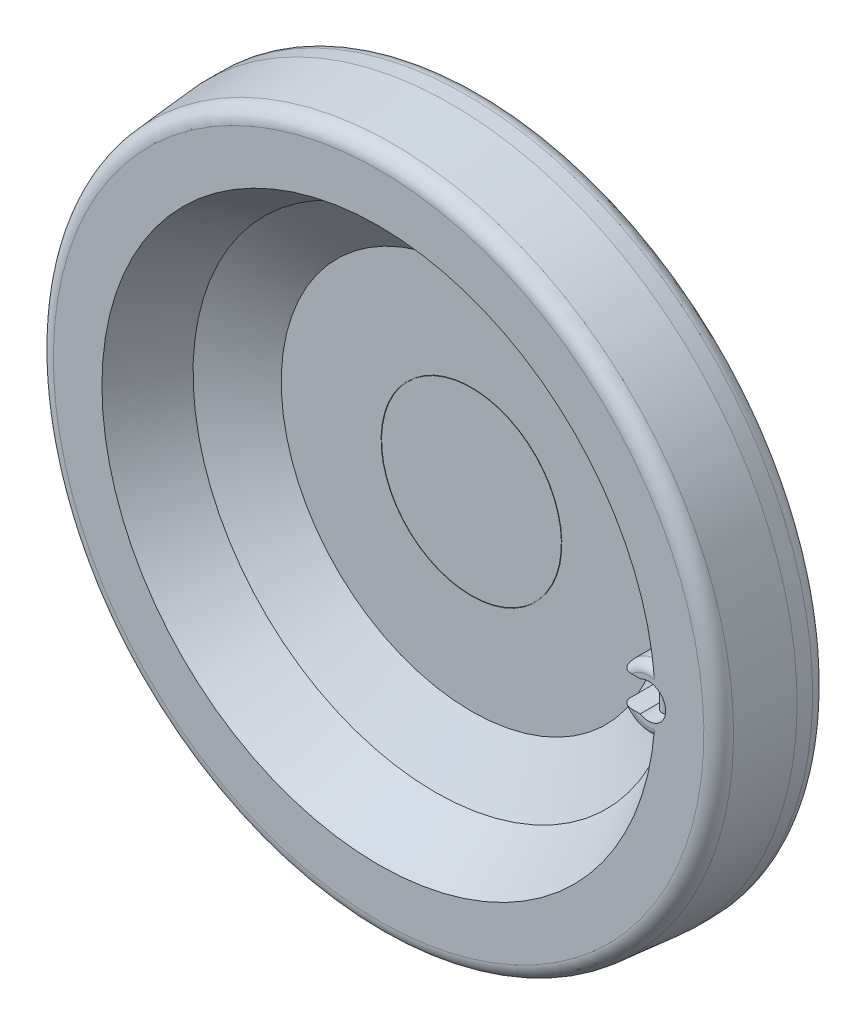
ISO-10303-21;
HEADER;
FILE_DESCRIPTION(('STEP AP214'),'2;1');
FILE_NAME('part.step','',(''),(''),'','','');
FILE_SCHEMA(('AUTOMOTIVE_DESIGN { 1 0 10303 214 1 1 1 1 }'));
ENDSEC;
DATA;
#1=APPLICATION_CONTEXT('core data for automotive mechanical design processes');
#2=APPLICATION_PROTOCOL_DEFINITION('international standard','automotive_design',2000,#1);
#3=PRODUCT_CONTEXT('',#1,'mechanical');
#4=PRODUCT('Part','Part','',(#3));
#5=PRODUCT_RELATED_PRODUCT_CATEGORY('part','',(#4));
#6=PRODUCT_DEFINITION_FORMATION('','',#4);
#7=PRODUCT_DEFINITION_CONTEXT('part definition',#1,'design');
#8=PRODUCT_DEFINITION('design','',#6,#7);
#9=PRODUCT_DEFINITION_SHAPE('','',#8);
#10=(LENGTH_UNIT() NAMED_UNIT(*) SI_UNIT(.MILLI.,.METRE.));
#11=(NAMED_UNIT(*) PLANE_ANGLE_UNIT() SI_UNIT($,.RADIAN.));
#12=(NAMED_UNIT(*) SI_UNIT($,.STERADIAN.) SOLID_ANGLE_UNIT());
#13=UNCERTAINTY_MEASURE_WITH_UNIT(LENGTH_MEASURE(1.E-05),#10,'distance_accuracy_value','');
#14=(GEOMETRIC_REPRESENTATION_CONTEXT(3) GLOBAL_UNCERTAINTY_ASSIGNED_CONTEXT((#13)) GLOBAL_UNIT_ASSIGNED_CONTEXT((#10,
#11,#12)) REPRESENTATION_CONTEXT('',''));
#15=CARTESIAN_POINT('',(0.,0.,0.));
#16=DIRECTION('',(0.,0.,1.));
#17=DIRECTION('',(1.,0.,0.));
#18=AXIS2_PLACEMENT_3D('',#15,#16,#17);
#19=CARTESIAN_POINT('',(0.,0.,68.));
#20=DIRECTION('',(0.,0.,1.));
#21=DIRECTION('',(0.,-1.,0.));
#22=AXIS2_PLACEMENT_3D('',#19,#20,#21);
#23=CONICAL_SURFACE('',#22,80.,0.549005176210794);
#24=CARTESIAN_POINT('',(76.0868546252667,9.56897696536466,62.5829845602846));
#25=CARTESIAN_POINT('',(76.0784445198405,9.50057382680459,62.5553914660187));
#26=CARTESIAN_POINT('',(76.0712727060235,9.43123065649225,62.529758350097));
#27=CARTESIAN_POINT('',(76.0586206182,9.2914049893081,62.4813109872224));
#28=CARTESIAN_POINT('',(76.0531411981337,9.22092193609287,62.4584981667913));
#29=CARTESIAN_POINT('',(76.038524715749,9.00816012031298,62.3932291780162));
#30=CARTESIAN_POINT('',(76.0312301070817,8.86476472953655,62.3540160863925));
#31=CARTESIAN_POINT('',(76.019523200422,8.57570812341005,62.2811547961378));
#32=CARTESIAN_POINT('',(76.0151263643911,8.43003893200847,62.2475371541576));
#33=CARTESIAN_POINT('',(76.0082953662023,8.13785119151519,62.1846892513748));
#34=CARTESIAN_POINT('',(76.0058594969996,7.99133349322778,62.1554551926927));
#35=CARTESIAN_POINT('',(76.0023204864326,7.69650142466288,62.1002196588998));
#36=CARTESIAN_POINT('',(76.0012278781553,7.54818195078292,62.0742451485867));
#37=CARTESIAN_POINT('',(76.0000083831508,7.25103018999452,62.0251896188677));
#38=CARTESIAN_POINT('',(75.999881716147,7.10219779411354,62.002109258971));
#39=CARTESIAN_POINT('',(76.0003121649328,6.80469277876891,61.9585012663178));
#40=CARTESIAN_POINT('',(76.0008668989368,6.65602141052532,61.9379650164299));
#41=CARTESIAN_POINT('',(76.0024547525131,6.35841282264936,61.8990493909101));
#42=CARTESIAN_POINT('',(76.0034878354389,6.20947562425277,61.8806698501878));
#43=CARTESIAN_POINT('',(76.0070309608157,5.76672155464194,61.8289150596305));
#44=CARTESIAN_POINT('',(76.0100013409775,5.4725843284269,61.7982984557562));
#45=CARTESIAN_POINT('',(76.0163578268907,4.88372953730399,61.7432427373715));
#46=CARTESIAN_POINT('',(76.0197439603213,4.5890119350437,61.7188040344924));
#47=CARTESIAN_POINT('',(76.0264098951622,3.99909861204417,61.6753011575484));
#48=CARTESIAN_POINT('',(76.0296896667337,3.70390278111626,61.6562384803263));
#49=CARTESIAN_POINT('',(76.0357899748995,3.11323126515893,61.6229571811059));
#50=CARTESIAN_POINT('',(76.0386105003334,2.81775557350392,61.608738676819));
#51=CARTESIAN_POINT('',(76.0460208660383,1.92877414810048,61.5726723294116));
#52=CARTESIAN_POINT('',(76.0495296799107,1.33497463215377,61.5575738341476));
#53=CARTESIAN_POINT('',(76.0527058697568,0.147364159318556,61.5438473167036));
#54=CARTESIAN_POINT('',(76.052374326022,-0.44644674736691,61.5452146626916));
#55=CARTESIAN_POINT('',(76.0479518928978,-1.63371130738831,61.5645292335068));
#56=CARTESIAN_POINT('',(76.0438616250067,-2.22716500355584,61.5824737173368));
#57=CARTESIAN_POINT('',(76.0357764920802,-3.11687917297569,61.6231699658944));
#58=CARTESIAN_POINT('',(76.0327551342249,-3.41347353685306,61.6390397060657));
#59=CARTESIAN_POINT('',(76.026356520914,-4.00633865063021,61.6758267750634));
#60=CARTESIAN_POINT('',(76.0229792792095,-4.30260941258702,61.6967439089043));
#61=CARTESIAN_POINT('',(76.0162903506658,-4.89324964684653,61.7441298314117));
#62=CARTESIAN_POINT('',(76.012978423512,-5.18762131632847,61.7705708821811));
#63=CARTESIAN_POINT('',(76.007013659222,-5.77576138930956,61.8300018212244));
#64=CARTESIAN_POINT('',(76.0043609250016,-6.06952969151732,61.8629927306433));
#65=CARTESIAN_POINT('',(76.0006474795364,-6.65578142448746,61.9368955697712));
#66=CARTESIAN_POINT('',(75.9995850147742,-6.94826591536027,61.9777987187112));
#67=CARTESIAN_POINT('',(76.0004220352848,-7.38571023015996,62.0469735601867));
#68=CARTESIAN_POINT('',(76.0011059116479,-7.53129217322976,62.0713314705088));
#69=CARTESIAN_POINT('',(76.0036259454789,-7.8218860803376,62.1231677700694));
#70=CARTESIAN_POINT('',(76.0054620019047,-7.9668980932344,62.1506458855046));
#71=CARTESIAN_POINT('',(76.0094573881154,-8.18413505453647,62.1948235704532));
#72=CARTESIAN_POINT('',(76.0110010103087,-8.2566654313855,62.2100810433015));
#73=CARTESIAN_POINT('',(76.0145956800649,-8.40147928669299,62.2417070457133));
#74=CARTESIAN_POINT('',(76.0166467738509,-8.47376274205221,62.2580756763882));
#75=CARTESIAN_POINT('',(76.0213771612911,-8.61822378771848,62.2921411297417));
#76=CARTESIAN_POINT('',(76.0240583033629,-8.69040042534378,62.3098417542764));
#77=CARTESIAN_POINT('',(76.0302004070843,-8.83432338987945,62.3467533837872));
#78=CARTESIAN_POINT('',(76.0336612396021,-8.90606978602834,62.3659641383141));
#79=CARTESIAN_POINT('',(76.0415307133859,-9.04810277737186,62.4059632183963));
#80=CARTESIAN_POINT('',(76.045926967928,-9.11839641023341,62.4267288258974));
#81=CARTESIAN_POINT('',(76.0559961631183,-9.25819457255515,62.4704807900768));
#82=CARTESIAN_POINT('',(76.0616688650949,-9.32769924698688,62.4934667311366));
#83=CARTESIAN_POINT('',(76.0747481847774,-9.46524900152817,62.5422520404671));
#84=CARTESIAN_POINT('',(76.0821479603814,-9.53329871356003,62.568040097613));
#85=CARTESIAN_POINT('',(76.0994714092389,-9.66740476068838,62.6235780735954));
#86=CARTESIAN_POINT('',(76.1093912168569,-9.7334639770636,62.6533218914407));
#87=CARTESIAN_POINT('',(76.1282253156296,-9.83416574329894,62.7048719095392));
#88=CARTESIAN_POINT('',(76.1357429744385,-9.87012053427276,62.7246037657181));
#89=CARTESIAN_POINT('',(76.1527016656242,-9.93994102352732,62.7668175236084));
#90=CARTESIAN_POINT('',(76.162140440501,-9.97380911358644,62.7892961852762));
#91=CARTESIAN_POINT('',(76.1792593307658,-10.0239918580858,62.8277254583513));
#92=CARTESIAN_POINT('',(76.1859697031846,-10.0416271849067,62.8423655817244));
#93=CARTESIAN_POINT('',(76.2006323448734,-10.0749102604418,62.8732488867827));
#94=CARTESIAN_POINT('',(76.2085835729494,-10.0905596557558,62.8894907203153));
#95=CARTESIAN_POINT('',(76.223422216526,-10.1144305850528,62.918665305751));
#96=CARTESIAN_POINT('',(76.2299096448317,-10.1234701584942,62.9311229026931));
#97=CARTESIAN_POINT('',(76.2437361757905,-10.1393392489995,62.9569453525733));
#98=CARTESIAN_POINT('',(76.2510734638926,-10.1461733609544,62.9703082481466));
#99=CARTESIAN_POINT('',(76.2649885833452,-10.1557872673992,62.9949299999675));
#100=CARTESIAN_POINT('',(76.2714142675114,-10.1591107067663,63.0060593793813));
#101=CARTESIAN_POINT('',(76.2846782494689,-10.163551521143,63.0285105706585));
#102=CARTESIAN_POINT('',(76.2915161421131,-10.1646710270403,63.0398321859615));
#103=CARTESIAN_POINT('',(76.3054232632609,-10.1645722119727,63.0623455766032));
#104=CARTESIAN_POINT('',(76.3124928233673,-10.1633503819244,63.0735371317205));
#105=CARTESIAN_POINT('',(76.3266354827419,-10.1587063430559,63.0954518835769));
#106=CARTESIAN_POINT('',(76.3337085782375,-10.1552818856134,63.1061745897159));
#107=CARTESIAN_POINT('',(76.3500116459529,-10.145117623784,63.1304024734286));
#108=CARTESIAN_POINT('',(76.3591751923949,-10.1376534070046,63.1436446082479));
#109=CARTESIAN_POINT('',(76.3770051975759,-10.1203134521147,63.1688111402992));
#110=CARTESIAN_POINT('',(76.3856703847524,-10.1104318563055,63.1807322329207));
#111=CARTESIAN_POINT('',(76.409047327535,-10.080613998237,63.2122282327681));
#112=CARTESIAN_POINT('',(76.4231813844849,-10.0588629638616,63.2304879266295));
#113=CARTESIAN_POINT('',(76.4500332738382,-10.0124993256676,63.2641425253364));
#114=CARTESIAN_POINT('',(76.4627464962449,-9.98787790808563,63.2795282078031));
#115=CARTESIAN_POINT('',(76.4943859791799,-9.9216296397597,63.3168263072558));
#116=CARTESIAN_POINT('',(76.5124492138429,-9.87868279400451,63.3370973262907));
#117=CARTESIAN_POINT('',(76.5466517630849,-9.79055697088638,63.3741897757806));
#118=CARTESIAN_POINT('',(76.5627861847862,-9.74537271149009,63.3910025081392));
#119=CARTESIAN_POINT('',(76.5937007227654,-9.65342864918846,63.4222512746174));
#120=CARTESIAN_POINT('',(76.6084725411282,-9.60666129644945,63.4366731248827));
#121=CARTESIAN_POINT('',(76.6368632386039,-9.51232714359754,63.4636350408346));
#122=CARTESIAN_POINT('',(76.6504835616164,-9.46476143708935,63.4761774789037));
#123=CARTESIAN_POINT('',(76.6940196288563,-9.30656365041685,63.5152864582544));
#124=CARTESIAN_POINT('',(76.722001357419,-9.19464756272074,63.5387906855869));
#125=CARTESIAN_POINT('',(76.7747426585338,-8.96915938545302,63.5810921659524));
#126=CARTESIAN_POINT('',(76.7994998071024,-8.85558612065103,63.5998858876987));
#127=CARTESIAN_POINT('',(76.8465982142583,-8.62716431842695,63.6341678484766));
#128=CARTESIAN_POINT('',(76.8689336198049,-8.5123133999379,63.6496481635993));
#129=CARTESIAN_POINT('',(76.9116064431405,-8.28193071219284,63.6781070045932));
#130=CARTESIAN_POINT('',(76.9319436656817,-8.16639887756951,63.6910852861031));
#131=CARTESIAN_POINT('',(76.9709162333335,-7.9349484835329,63.7150796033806));
#132=CARTESIAN_POINT('',(76.9895529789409,-7.81903032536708,63.7260972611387));
#133=CARTESIAN_POINT('',(77.0253656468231,-7.58682433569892,63.746568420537));
#134=CARTESIAN_POINT('',(77.0425414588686,-7.47053647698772,63.7560218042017));
#135=CARTESIAN_POINT('',(77.075566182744,-7.23786684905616,63.7736290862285));
#136=CARTESIAN_POINT('',(77.0914171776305,-7.12148552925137,63.7817850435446));
#137=CARTESIAN_POINT('',(77.1219439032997,-6.88850301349,63.7970241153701));
#138=CARTESIAN_POINT('',(77.1366196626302,-6.77190182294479,63.804107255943));
#139=CARTESIAN_POINT('',(77.1787416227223,-6.42423838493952,63.8238654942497));
#140=CARTESIAN_POINT('',(77.2046192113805,-6.19290995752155,63.8352237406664));
#141=CARTESIAN_POINT('',(77.2526983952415,-5.72975431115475,63.8553159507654));
#142=CARTESIAN_POINT('',(77.2748997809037,-5.49792706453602,63.8640497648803));
#143=CARTESIAN_POINT('',(77.3365638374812,-4.80182190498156,63.8872750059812));
#144=CARTESIAN_POINT('',(77.3710768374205,-4.33700210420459,63.8987861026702));
#145=CARTESIAN_POINT('',(77.4287674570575,-3.40571624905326,63.9169152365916));
#146=CARTESIAN_POINT('',(77.4519235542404,-2.93924874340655,63.9235239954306));
#147=CARTESIAN_POINT('',(77.4877379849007,-2.00593121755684,63.933370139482));
#148=CARTESIAN_POINT('',(77.500397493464,-1.53908124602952,63.9366079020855));
#149=CARTESIAN_POINT('',(77.5157680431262,-0.600359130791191,63.9405069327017));
#150=CARTESIAN_POINT('',(77.5183743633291,-0.128485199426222,63.9411410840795));
#151=CARTESIAN_POINT('',(77.5134418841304,0.815240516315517,63.9399115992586));
#152=CARTESIAN_POINT('',(77.5059023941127,1.28709229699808,63.9380477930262));
#153=CARTESIAN_POINT('',(77.4804364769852,2.22926218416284,63.931376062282));
#154=CARTESIAN_POINT('',(77.4625372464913,2.69958107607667,63.9265758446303));
#155=CARTESIAN_POINT('',(77.4156899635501,3.63956944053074,63.9129001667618));
#156=CARTESIAN_POINT('',(77.3867433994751,4.10923899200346,63.9040252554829));
#157=CARTESIAN_POINT('',(77.3354294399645,4.7940098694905,63.8864286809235));
#158=CARTESIAN_POINT('',(77.3179573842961,5.00954793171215,63.8802149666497));
#159=CARTESIAN_POINT('',(77.2801687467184,5.44035591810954,63.8660766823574));
#160=CARTESIAN_POINT('',(77.2598517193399,5.65562579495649,63.8581518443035));
#161=CARTESIAN_POINT('',(77.2159758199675,6.08693817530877,63.8400707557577));
#162=CARTESIAN_POINT('',(77.192399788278,6.30297844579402,63.8299025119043));
#163=CARTESIAN_POINT('',(77.1416998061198,6.7343799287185,63.8066794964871));
#164=CARTESIAN_POINT('',(77.1145777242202,6.94974143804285,63.7936262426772));
#165=CARTESIAN_POINT('',(77.0568066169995,7.37492970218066,63.7639177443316));
#166=CARTESIAN_POINT('',(77.0262476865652,7.58477450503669,63.74734750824));
#167=CARTESIAN_POINT('',(76.9601941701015,8.00365762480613,63.7088843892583));
#168=CARTESIAN_POINT('',(76.9246902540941,8.21269363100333,63.6869813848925));
#169=CARTESIAN_POINT('',(76.8666873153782,8.52362519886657,63.6480637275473));
#170=CARTESIAN_POINT('',(76.8466636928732,8.62636965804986,63.6341575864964));
#171=CARTESIAN_POINT('',(76.8046294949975,8.831130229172,63.6036710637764));
#172=CARTESIAN_POINT('',(76.7826177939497,8.93314589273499,63.587089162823));
#173=CARTESIAN_POINT('',(76.7361536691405,9.13559738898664,63.5503404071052));
#174=CARTESIAN_POINT('',(76.7117097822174,9.23603740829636,63.5301859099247));
#175=CARTESIAN_POINT('',(76.6594348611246,9.43480003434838,63.4846242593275));
#176=CARTESIAN_POINT('',(76.6316083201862,9.53312525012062,63.459224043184));
#177=CARTESIAN_POINT('',(76.5940954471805,9.65143853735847,63.4225031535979));
#178=CARTESIAN_POINT('',(76.5869167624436,9.67351644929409,63.4153779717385));
#179=CARTESIAN_POINT('',(76.5722254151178,9.71737287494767,63.4005571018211));
#180=CARTESIAN_POINT('',(76.5647126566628,9.73915130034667,63.3928612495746));
#181=CARTESIAN_POINT('',(76.5415657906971,9.80405220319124,63.3687451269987));
#182=CARTESIAN_POINT('',(76.5253583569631,9.8466269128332,63.3513303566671));
#183=CARTESIAN_POINT('',(76.4935053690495,9.92282047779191,63.315654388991));
#184=CARTESIAN_POINT('',(76.4781539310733,9.95681231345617,63.2979313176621));
#185=CARTESIAN_POINT('',(76.4454253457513,10.0213641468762,63.258551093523));
#186=CARTESIAN_POINT('',(76.4280596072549,10.0519417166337,63.2369157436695));
#187=CARTESIAN_POINT('',(76.4019095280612,10.0896626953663,63.2025992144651));
#188=CARTESIAN_POINT('',(76.3942703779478,10.0998127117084,63.1923930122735));
#189=CARTESIAN_POINT('',(76.3785303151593,10.1185318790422,63.1709000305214));
#190=CARTESIAN_POINT('',(76.370429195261,10.1271003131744,63.1596127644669));
#191=CARTESIAN_POINT('',(76.353699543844,10.1421463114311,63.1357385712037));
#192=CARTESIAN_POINT('',(76.3450652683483,10.14859332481,63.1231358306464));
#193=CARTESIAN_POINT('',(76.3275856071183,10.158450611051,63.0969360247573));
#194=CARTESIAN_POINT('',(76.3187408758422,10.1618692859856,63.0833418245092));
#195=CARTESIAN_POINT('',(76.3021181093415,10.1649630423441,63.057074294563));
#196=CARTESIAN_POINT('',(76.294325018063,10.1649913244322,63.0444527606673));
#197=CARTESIAN_POINT('',(76.2791587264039,10.1621850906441,63.0192719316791));
#198=CARTESIAN_POINT('',(76.2717859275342,10.1593478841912,63.0067127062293));
#199=CARTESIAN_POINT('',(76.2568044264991,10.1506954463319,62.9805699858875));
#200=CARTESIAN_POINT('',(76.249277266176,10.1445582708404,62.9670492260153));
#201=CARTESIAN_POINT('',(76.2350743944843,10.1299147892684,62.9408795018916));
#202=CARTESIAN_POINT('',(76.2284003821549,10.1214038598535,62.9282322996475));
#203=CARTESIAN_POINT('',(76.2114567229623,10.0961681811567,62.8953500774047));
#204=CARTESIAN_POINT('',(76.2019248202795,10.0778541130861,62.8759732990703));
#205=CARTESIAN_POINT('',(76.1845774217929,10.0384567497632,62.8394309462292));
#206=CARTESIAN_POINT('',(76.1767670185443,10.017365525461,62.822271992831));
#207=CARTESIAN_POINT('',(76.1592624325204,9.9638636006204,62.7825214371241));
#208=CARTESIAN_POINT('',(76.1502493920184,9.93055256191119,62.7608573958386));
#209=CARTESIAN_POINT('',(76.1339875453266,9.86198643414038,62.7200496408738));
#210=CARTESIAN_POINT('',(76.1267425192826,9.8267273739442,62.7009113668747));
#211=CARTESIAN_POINT('',(76.1134974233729,9.75481936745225,62.6644408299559));
#212=CARTESIAN_POINT('',(76.1075044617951,9.71816381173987,62.6471191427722));
#213=CARTESIAN_POINT('',(76.0965012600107,9.64409237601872,62.6139958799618));
#214=CARTESIAN_POINT('',(76.0914898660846,9.60667744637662,62.5981925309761));
#215=CARTESIAN_POINT('',(76.0868546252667,9.56897696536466,62.5829845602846));
#216=B_SPLINE_CURVE_WITH_KNOTS('',3,(#24,#25,#26,#27,#28,#29,#30,#31,#32,#33,#34,#35,#36,#37,
#38,#39,#40,#41,#42,#43,#44,#45,#46,#47,#48,#49,#50,#51,#52,#53,#54,#55,#56,#57,#58,#59,#60,#61,
#62,#63,#64,#65,#66,#67,#68,#69,#70,#71,#72,#73,#74,#75,#76,#77,#78,#79,#80,#81,#82,#83,#84,#85,
#86,#87,#88,#89,#90,#91,#92,#93,#94,#95,#96,#97,#98,#99,#100,#101,#102,#103,#104,#105,#106,#107,
#108,#109,#110,#111,#112,#113,#114,#115,#116,#117,#118,#119,#120,#121,#122,#123,#124,#125,#126,
#127,#128,#129,#130,#131,#132,#133,#134,#135,#136,#137,#138,#139,#140,#141,#142,#143,#144,#145,
#146,#147,#148,#149,#150,#151,#152,#153,#154,#155,#156,#157,#158,#159,#160,#161,#162,#163,#164,
#165,#166,#167,#168,#169,#170,#171,#172,#173,#174,#175,#176,#177,#178,#179,#180,#181,#182,#183,
#184,#185,#186,#187,#188,#189,#190,#191,#192,#193,#194,#195,#196,#197,#198,#199,#200,#201,#202,
#203,#204,#205,#206,#207,#208,#209,#210,#211,#212,#213,#214,#215),.UNSPECIFIED.,.T.,.F.,(4,2,2,
2,2,2,2,2,2,2,2,2,2,2,2,2,2,2,2,2,2,2,2,2,2,2,2,2,2,2,2,2,2,2,2,2,2,2,2,2,2,2,2,2,2,2,2,2,2,2,2,
2,2,2,2,2,2,2,2,2,2,2,2,2,2,2,2,2,2,2,2,2,2,2,2,2,2,2,2,2,2,2,2,2,2,2,2,2,2,2,2,2,2,2,2,4),(0.,
0.222693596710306,0.445499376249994,0.891740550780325,1.34034390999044,1.78855633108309,
2.24026141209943,2.69206923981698,3.14230229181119,3.59250085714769,4.47963539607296,
5.36682902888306,6.25426943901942,7.14173141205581,8.92345168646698,10.7046707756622,
12.4855953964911,13.3766634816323,14.267697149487,15.1543597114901,16.0411606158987,
16.926982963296,17.3697775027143,17.812533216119,18.0349266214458,18.2573402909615,
18.4804148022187,18.7034523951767,18.9237023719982,19.1439112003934,19.3632620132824,
19.5822783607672,19.7072682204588,19.8321120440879,19.903652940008,19.975134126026,
20.0251032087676,20.0749675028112,20.1146210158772,20.1542361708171,20.1939107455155,
20.2336258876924,20.28657141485,20.3396465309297,20.4342768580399,20.5292058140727,
20.6812397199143,20.8336514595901,20.9869373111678,21.1400280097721,21.4929321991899,
21.8461001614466,22.2001035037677,22.5541414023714,22.9078850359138,23.2616553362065,
23.614858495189,23.9680530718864,24.6671362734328,25.3662593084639,26.7647518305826,
28.1658844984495,29.5668602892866,30.9823908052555,32.3980176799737,33.8099449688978,
35.2216821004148,35.8706653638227,36.5197503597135,37.1723933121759,37.8246937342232,
38.4627299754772,39.1019867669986,39.418741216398,39.7356761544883,40.0515354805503,
40.3669797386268,40.43982258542,40.5126864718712,40.6587843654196,40.7825065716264,
40.9055594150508,40.9543573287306,41.0031773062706,41.0526723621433,41.1020296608,
41.1462400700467,41.1904920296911,41.2401592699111,41.2899239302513,41.3743885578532,
41.4590997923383,41.581048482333,41.703255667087,41.8261388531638,41.9488767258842),.UNSPECIFIED.);
#217=CARTESIAN_POINT('',(76.4561796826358,-10.,63.2714600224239));
#218=VERTEX_POINT('',#217);
#219=CARTESIAN_POINT('',(76.7855628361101,-8.91768705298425,63.5890664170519));
#220=VERTEX_POINT('',#219);
#221=EDGE_CURVE('E38',#218,#220,#216,.T.);
#222=ORIENTED_EDGE('',*,*,#221,.F.);
#223=CARTESIAN_POINT('',(81.450376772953,-10.,71.3706487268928));
#224=CARTESIAN_POINT('',(80.5626493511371,-10.,69.9303073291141));
#225=CARTESIAN_POINT('',(79.6747672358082,-10.,68.4900612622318));
#226=CARTESIAN_POINT('',(77.8986577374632,-10.,65.6097821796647));
#227=CARTESIAN_POINT('',(77.0104303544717,-10.,64.1697491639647));
#228=CARTESIAN_POINT('',(75.233594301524,-10.,61.2899183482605));
#229=CARTESIAN_POINT('',(74.3449856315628,-10.,59.8501205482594));
#230=CARTESIAN_POINT('',(72.5673426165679,-10.,56.9707876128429));
#231=CARTESIAN_POINT('',(71.6783082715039,-10.,55.5312524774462));
#232=CARTESIAN_POINT('',(70.7890389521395,-10.,54.0918624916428));
#233=B_SPLINE_CURVE_WITH_KNOTS('',3,(#223,#224,#225,#226,#227,#228,#229,#230,#231,#232),
.UNSPECIFIED.,.F.,.F.,(4,2,2,2,4),(0.,5.07580436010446,10.1516083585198,15.2274124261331,
20.3032168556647),.UNSPECIFIED.);
#234=CARTESIAN_POINT('',(76.1710986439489,-10.,62.8093914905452));
#235=VERTEX_POINT('',#234);
#236=EDGE_CURVE('E9',#218,#235,#233,.T.);
#237=ORIENTED_EDGE('',*,*,#236,.T.);
#238=CARTESIAN_POINT('',(76.0279463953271,-8.78128718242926,62.3331702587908));
#239=VERTEX_POINT('',#238);
#240=EDGE_CURVE('E117',#239,#235,#216,.T.);
#241=ORIENTED_EDGE('',*,*,#240,.F.);
#242=CARTESIAN_POINT('',(69.8909158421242,-3.90419698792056,51.652913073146));
#243=CARTESIAN_POINT('',(69.9567665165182,-4.0409204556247,51.7728630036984));
#244=CARTESIAN_POINT('',(70.0247357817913,-4.17329540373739,51.8964794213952));
#245=CARTESIAN_POINT('',(70.1642956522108,-4.42980130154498,52.1498684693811));
#246=CARTESIAN_POINT('',(70.2358836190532,-4.55393810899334,52.2796366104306));
#247=CARTESIAN_POINT('',(70.381922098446,-4.79422210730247,52.5438949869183));
#248=CARTESIAN_POINT('',(70.4563624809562,-4.91039410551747,52.678368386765));
#249=CARTESIAN_POINT('',(70.6079179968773,-5.1357137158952,52.9516535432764));
#250=CARTESIAN_POINT('',(70.6850336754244,-5.24485988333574,53.0904661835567));
#251=CARTESIAN_POINT('',(70.918304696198,-5.56036483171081,53.5095909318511));
#252=CARTESIAN_POINT('',(71.0778524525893,-5.75716061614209,53.7952486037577));
#253=CARTESIAN_POINT('',(71.4041479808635,-6.12827953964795,54.3772262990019));
#254=CARTESIAN_POINT('',(71.5709036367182,-6.30257719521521,54.6735579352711));
#255=CARTESIAN_POINT('',(71.8884471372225,-6.6099375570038,55.2356551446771));
#256=CARTESIAN_POINT('',(72.0385536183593,-6.74542350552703,55.5004897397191));
#257=CARTESIAN_POINT('',(72.3424743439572,-7.00228498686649,56.0348695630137));
#258=CARTESIAN_POINT('',(72.496289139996,-7.12365840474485,56.3044154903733));
#259=CARTESIAN_POINT('',(72.8071200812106,-7.35332144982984,56.8472448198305));
#260=CARTESIAN_POINT('',(72.9641366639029,-7.46160927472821,57.120528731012));
#261=CARTESIAN_POINT('',(73.280972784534,-7.66591895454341,57.6700721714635));
#262=CARTESIAN_POINT('',(73.4407926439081,-7.76193939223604,57.9463320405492));
#263=CARTESIAN_POINT('',(73.7642038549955,-7.94308896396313,58.5034388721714));
#264=CARTESIAN_POINT('',(73.9278152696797,-8.02812358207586,58.7843048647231));
#265=CARTESIAN_POINT('',(74.2572799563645,-8.18690843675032,59.3479161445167));
#266=CARTESIAN_POINT('',(74.4231333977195,-8.2606578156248,59.6306615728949));
#267=CARTESIAN_POINT('',(74.9235572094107,-8.46555089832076,60.4808115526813));
#268=CARTESIAN_POINT('',(75.2611539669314,-8.58042962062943,61.0504104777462));
#269=CARTESIAN_POINT('',(75.9850848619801,-8.78055180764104,62.2633894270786));
#270=CARTESIAN_POINT('',(76.3722712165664,-8.86035357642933,62.9071595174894));
#271=CARTESIAN_POINT('',(76.9554496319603,-8.94129660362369,63.8693778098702));
#272=CARTESIAN_POINT('',(77.1491181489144,-8.96180863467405,64.1877175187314));
#273=CARTESIAN_POINT('',(77.5377895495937,-8.99023271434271,64.8241960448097));
#274=CARTESIAN_POINT('',(77.7327925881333,-8.99814327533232,65.1423348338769));
#275=CARTESIAN_POINT('',(77.9283557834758,-8.99971483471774,65.4602));
#276=B_SPLINE_CURVE_WITH_KNOTS('',3,(#242,#243,#244,#245,#246,#247,#248,#249,#250,#251,#252,
#253,#254,#255,#256,#257,#258,#259,#260,#261,#262,#263,#264,#265,#266,#267,#268,#269,#270,#271,
#272,#273,#274,#275),.UNSPECIFIED.,.F.,.F.,(4,2,2,2,2,2,2,2,2,2,2,2,2,2,2,2,4),(0.,
0.580098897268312,1.15978079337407,1.7375664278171,2.31547049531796,3.45975708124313,
4.60532862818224,5.60456249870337,6.60394592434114,7.60346684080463,8.60310312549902,
9.61083617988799,10.6186457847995,12.6332567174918,14.8976984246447,16.0170756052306,
17.1365849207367),.UNSPECIFIED.);
#277=CARTESIAN_POINT('',(69.8910256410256,-3.90442503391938,51.653113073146));
#278=VERTEX_POINT('',#277);
#279=EDGE_CURVE('E106',#278,#239,#276,.T.);
#280=ORIENTED_EDGE('',*,*,#279,.F.);
#281=CARTESIAN_POINT('',(0.,0.,51.653113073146));
#282=DIRECTION('',(0.,0.,1.));
#283=DIRECTION('',(0.,-1.,0.));
#284=AXIS2_PLACEMENT_3D('',#281,#282,#283);
#285=CIRCLE('',#284,70.);
#286=CARTESIAN_POINT('',(69.8910256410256,3.90442503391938,51.653113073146));
#287=VERTEX_POINT('',#286);
#288=EDGE_CURVE('E267',#287,#278,#285,.T.);
#289=ORIENTED_EDGE('',*,*,#288,.F.);
#290=CARTESIAN_POINT('',(77.9283557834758,8.99971483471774,65.4602));
#291=CARTESIAN_POINT('',(77.7321357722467,8.99813435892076,65.1412682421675));
#292=CARTESIAN_POINT('',(77.536463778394,8.99017685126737,64.8220335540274));
#293=CARTESIAN_POINT('',(77.1464366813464,8.96157094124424,64.1833177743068));
#294=CARTESIAN_POINT('',(76.952081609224,8.94092224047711,63.8638366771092));
#295=CARTESIAN_POINT('',(76.5646184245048,8.88695540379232,63.2245074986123));
#296=CARTESIAN_POINT('',(76.3715127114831,8.8536176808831,62.9046596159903));
#297=CARTESIAN_POINT('',(75.9870801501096,8.77420561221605,62.2654763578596));
#298=CARTESIAN_POINT('',(75.7957532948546,8.72813131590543,61.946140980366));
#299=CARTESIAN_POINT('',(75.4097665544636,8.62159464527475,61.2994325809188));
#300=CARTESIAN_POINT('',(75.2151640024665,8.56076447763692,60.9720857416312));
#301=CARTESIAN_POINT('',(74.8283694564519,8.42512691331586,60.3188686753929));
#302=CARTESIAN_POINT('',(74.6361774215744,8.35031975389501,59.992998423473));
#303=CARTESIAN_POINT('',(74.2546356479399,8.18628997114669,59.3435090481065));
#304=CARTESIAN_POINT('',(74.0652841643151,8.09707662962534,59.0198886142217));
#305=CARTESIAN_POINT('',(73.6896899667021,7.90353424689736,58.3754156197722));
#306=CARTESIAN_POINT('',(73.5034469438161,7.79920671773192,58.0545627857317));
#307=CARTESIAN_POINT('',(73.0970279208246,7.55171723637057,57.3516296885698));
#308=CARTESIAN_POINT('',(72.8776389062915,7.40497117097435,56.9703430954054));
#309=CARTESIAN_POINT('',(72.4449598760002,7.08616761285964,56.214827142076));
#310=CARTESIAN_POINT('',(72.2316707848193,6.91410630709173,55.8405988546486));
#311=CARTESIAN_POINT('',(71.8146951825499,6.54362900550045,55.1055967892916));
#312=CARTESIAN_POINT('',(71.6109339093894,6.34549412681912,54.7447258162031));
#313=CARTESIAN_POINT('',(71.3124618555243,6.02478896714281,54.2137602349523));
#314=CARTESIAN_POINT('',(71.2141803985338,5.91398854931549,54.0385207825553));
#315=CARTESIAN_POINT('',(71.0203468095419,5.68393190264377,53.6921469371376));
#316=CARTESIAN_POINT('',(70.9247942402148,5.56467703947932,53.5210118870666));
#317=CARTESIAN_POINT('',(70.7463838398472,5.32959264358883,53.2007907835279));
#318=CARTESIAN_POINT('',(70.6632216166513,5.21464315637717,53.0512292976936));
#319=CARTESIAN_POINT('',(70.4998812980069,4.97684765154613,52.7569206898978));
#320=CARTESIAN_POINT('',(70.4197020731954,4.85400467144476,52.6121717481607));
#321=CARTESIAN_POINT('',(70.2622813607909,4.59895094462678,52.327461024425));
#322=CARTESIAN_POINT('',(70.1850621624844,4.46668487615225,52.1875361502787));
#323=CARTESIAN_POINT('',(70.0347200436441,4.19268728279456,51.9146372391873));
#324=CARTESIAN_POINT('',(69.9616013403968,4.05094632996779,51.7816703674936));
#325=CARTESIAN_POINT('',(69.8909158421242,3.90419698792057,51.652913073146));
#326=B_SPLINE_CURVE_WITH_KNOTS('',3,(#290,#291,#292,#293,#294,#295,#296,#297,#298,#299,#300,
#301,#302,#303,#304,#305,#306,#307,#308,#309,#310,#311,#312,#313,#314,#315,#316,#317,#318,#319,
#320,#321,#322,#323,#324,#325),.UNSPECIFIED.,.F.,.F.,(4,2,2,2,2,2,2,2,2,2,2,2,2,2,2,2,2,4),(0.,
1.12332964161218,2.24668569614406,3.37178286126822,4.49687565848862,5.6535710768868,
6.81024686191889,7.96618036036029,9.12199829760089,10.5124608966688,11.9031331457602,
13.2798816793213,13.9680488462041,14.6561051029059,15.2743526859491,15.8923637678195,
16.5143618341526,17.1369883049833),.UNSPECIFIED.);
#327=CARTESIAN_POINT('',(76.0279463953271,8.78128718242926,62.3331702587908));
#328=VERTEX_POINT('',#327);
#329=EDGE_CURVE('E251',#328,#287,#326,.T.);
#330=ORIENTED_EDGE('',*,*,#329,.F.);
#331=CARTESIAN_POINT('',(76.1710986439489,10.,62.8093914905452));
#332=VERTEX_POINT('',#331);
#333=EDGE_CURVE('E499',#332,#328,#216,.T.);
#334=ORIENTED_EDGE('',*,*,#333,.F.);
#335=CARTESIAN_POINT('',(81.450376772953,10.,71.3706487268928));
#336=CARTESIAN_POINT('',(80.5626493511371,10.,69.9303073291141));
#337=CARTESIAN_POINT('',(79.6747672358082,10.,68.4900612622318));
#338=CARTESIAN_POINT('',(77.8986577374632,10.,65.6097821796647));
#339=CARTESIAN_POINT('',(77.0104303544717,10.,64.1697491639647));
#340=CARTESIAN_POINT('',(75.233594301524,10.,61.2899183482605));
#341=CARTESIAN_POINT('',(74.3449856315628,10.,59.8501205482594));
#342=CARTESIAN_POINT('',(72.5673426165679,10.,56.9707876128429));
#343=CARTESIAN_POINT('',(71.6783082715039,10.,55.5312524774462));
#344=CARTESIAN_POINT('',(70.7890389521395,10.,54.0918624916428));
#345=B_SPLINE_CURVE_WITH_KNOTS('',3,(#335,#336,#337,#338,#339,#340,#341,#342,#343,#344),
.UNSPECIFIED.,.F.,.F.,(4,2,2,2,4),(0.,5.07580436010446,10.1516083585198,15.2274124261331,
20.3032168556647),.UNSPECIFIED.);
#346=CARTESIAN_POINT('',(76.4561796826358,10.,63.2714600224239));
#347=VERTEX_POINT('',#346);
#348=EDGE_CURVE('E28',#347,#332,#345,.T.);
#349=ORIENTED_EDGE('',*,*,#348,.F.);
#350=CARTESIAN_POINT('',(76.7855628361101,8.91768705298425,63.5890664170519));
#351=VERTEX_POINT('',#350);
#352=EDGE_CURVE('E122',#351,#347,#216,.T.);
#353=ORIENTED_EDGE('',*,*,#352,.F.);
#354=CARTESIAN_POINT('',(77.9282327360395,8.99971385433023,65.4599999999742));
#355=VERTEX_POINT('',#354);
#356=EDGE_CURVE('E244',#355,#351,#326,.T.);
#357=ORIENTED_EDGE('',*,*,#356,.F.);
#358=CARTESIAN_POINT('',(78.3488378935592,3.90444774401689,65.4598));
#359=CARTESIAN_POINT('',(78.3767344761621,3.90195460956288,65.5051429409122));
#360=CARTESIAN_POINT('',(78.4046183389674,3.90037431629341,65.5505396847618));
#361=CARTESIAN_POINT('',(78.4603333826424,3.89909508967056,65.6414001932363));
#362=CARTESIAN_POINT('',(78.4881645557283,3.89939641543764,65.68686396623));
#363=CARTESIAN_POINT('',(78.5716827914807,3.90321416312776,65.8235316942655));
#364=CARTESIAN_POINT('',(78.6272374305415,3.90965902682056,65.9147566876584));
#365=CARTESIAN_POINT('',(78.738412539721,3.93122974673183,66.0980228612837));
#366=CARTESIAN_POINT('',(78.7940218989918,3.94648221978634,66.1900562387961));
#367=CARTESIAN_POINT('',(78.903845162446,3.98680143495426,66.3726678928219));
#368=CARTESIAN_POINT('',(78.9580607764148,4.01185547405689,66.4632478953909));
#369=CARTESIAN_POINT('',(79.0762062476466,4.07982774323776,66.6618034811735));
#370=CARTESIAN_POINT('',(79.1396229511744,4.12547600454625,66.7691803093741));
#371=CARTESIAN_POINT('',(79.2610435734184,4.23532795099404,66.9768548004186));
#372=CARTESIAN_POINT('',(79.3190702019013,4.29944863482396,67.077181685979));
#373=CARTESIAN_POINT('',(79.4005672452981,4.41063098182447,67.2202016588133));
#374=CARTESIAN_POINT('',(79.4269603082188,4.45049739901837,67.2669051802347));
#375=CARTESIAN_POINT('',(79.4773964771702,4.53510810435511,67.3570297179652));
#376=CARTESIAN_POINT('',(79.5014407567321,4.57984993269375,67.400452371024));
#377=CARTESIAN_POINT('',(79.5468628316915,4.67400715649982,67.4835182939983));
#378=CARTESIAN_POINT('',(79.5682394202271,4.72342464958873,67.5231598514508));
#379=CARTESIAN_POINT('',(79.6080258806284,4.82648519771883,67.5981709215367));
#380=CARTESIAN_POINT('',(79.6264361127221,4.88012773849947,67.6335409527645));
#381=CARTESIAN_POINT('',(79.672453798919,5.03204147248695,67.7239824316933));
#382=CARTESIAN_POINT('',(79.6968692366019,5.13412359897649,67.7744152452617));
#383=CARTESIAN_POINT('',(79.7354744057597,5.34617362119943,67.8601237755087));
#384=CARTESIAN_POINT('',(79.7496634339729,5.4561420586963,67.8953984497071));
#385=CARTESIAN_POINT('',(79.7678019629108,5.67932329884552,67.950386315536));
#386=CARTESIAN_POINT('',(79.7718666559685,5.79248464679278,67.9702727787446));
#387=CARTESIAN_POINT('',(79.7705603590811,6.0203114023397,67.9956426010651));
#388=CARTESIAN_POINT('',(79.7651874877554,6.13497710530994,68.0011230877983));
#389=CARTESIAN_POINT('',(79.7445636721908,6.37644658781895,67.9983470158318));
#390=CARTESIAN_POINT('',(79.7282536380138,6.50313934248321,67.9884483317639));
#391=CARTESIAN_POINT('',(79.6858131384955,6.75263536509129,67.9531062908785));
#392=CARTESIAN_POINT('',(79.6596774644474,6.87543653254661,67.9276546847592));
#393=CARTESIAN_POINT('',(79.5944102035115,7.13162697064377,67.858021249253));
#394=CARTESIAN_POINT('',(79.5539760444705,7.26411078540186,67.811725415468));
#395=CARTESIAN_POINT('',(79.4633345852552,7.5185319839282,67.7026870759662));
#396=CARTESIAN_POINT('',(79.4131225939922,7.64046426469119,67.6399366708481));
#397=CARTESIAN_POINT('',(79.298017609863,7.88530409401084,67.4915994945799));
#398=CARTESIAN_POINT('',(79.2320910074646,8.0066249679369,67.4041906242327));
#399=CARTESIAN_POINT('',(79.0920055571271,8.23089778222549,67.2137921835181));
#400=CARTESIAN_POINT('',(79.0178435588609,8.33384265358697,67.1107966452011));
#401=CARTESIAN_POINT('',(78.8574343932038,8.52637458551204,66.883464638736));
#402=CARTESIAN_POINT('',(78.7706968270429,8.61434128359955,66.7580991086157));
#403=CARTESIAN_POINT('',(78.5926324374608,8.76444084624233,66.4957119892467));
#404=CARTESIAN_POINT('',(78.5013058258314,8.82657490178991,66.3586909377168));
#405=CARTESIAN_POINT('',(78.3292023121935,8.91676990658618,66.0957209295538));
#406=CARTESIAN_POINT('',(78.24867449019,8.94830913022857,65.9707907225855));
#407=CARTESIAN_POINT('',(78.0878303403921,8.99012077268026,65.7173729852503));
#408=CARTESIAN_POINT('',(78.007513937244,9.00040222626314,65.5888869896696));
#409=CARTESIAN_POINT('',(77.9281096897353,8.99971286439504,65.4598));
#410=B_SPLINE_CURVE_WITH_KNOTS('',3,(#358,#359,#360,#361,#362,#363,#364,#365,#366,#367,#368,
#369,#370,#371,#372,#373,#374,#375,#376,#377,#378,#379,#380,#381,#382,#383,#384,#385,#386,#387,
#388,#389,#390,#391,#392,#393,#394,#395,#396,#397,#398,#399,#400,#401,#402,#403,#404,#405,#406,
#407,#408,#409),.UNSPECIFIED.,.F.,.F.,(4,2,2,2,2,2,2,2,2,2,2,2,2,2,2,2,2,2,2,2,2,2,2,2,2,4),(0.,
0.159870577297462,0.31976317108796,0.640446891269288,0.965859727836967,1.29085221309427,
1.68794214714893,2.08327496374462,2.28353004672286,2.48368455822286,2.68392929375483,
2.88414969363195,3.23160274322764,3.57907968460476,3.92258467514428,4.26615815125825,
4.64901081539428,5.0320667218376,5.46844150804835,5.90502617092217,6.39319014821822,
6.88154151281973,7.40718513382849,7.93280451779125,8.38713640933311,8.84127516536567),.UNSPECIFIED.);
#411=CARTESIAN_POINT('',(79.7581307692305,6.21615445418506,68.));
#412=VERTEX_POINT('',#411);
#413=EDGE_CURVE('E210',#412,#355,#410,.T.);
#414=ORIENTED_EDGE('',*,*,#413,.F.);
#415=CARTESIAN_POINT('',(0.,0.,68.));
#416=DIRECTION('',(0.,0.,1.));
#417=DIRECTION('',(0.,-1.,0.));
#418=AXIS2_PLACEMENT_3D('',#415,#416,#417);
#419=CIRCLE('',#418,80.);
#420=CARTESIAN_POINT('',(79.7581307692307,-6.21615445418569,68.));
#421=VERTEX_POINT('',#420);
#422=EDGE_CURVE('E269',#412,#421,#419,.T.);
#423=ORIENTED_EDGE('',*,*,#422,.T.);
#424=CARTESIAN_POINT('',(77.9281096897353,-8.99971286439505,65.4598));
#425=CARTESIAN_POINT('',(77.9752728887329,-9.00009326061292,65.536460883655));
#426=CARTESIAN_POINT('',(78.0227418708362,-8.99663749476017,65.6128966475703));
#427=CARTESIAN_POINT('',(78.1179770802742,-8.98214704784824,65.7648445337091));
#428=CARTESIAN_POINT('',(78.1657432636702,-8.97111346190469,65.8403567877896));
#429=CARTESIAN_POINT('',(78.3088907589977,-8.92682974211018,66.0646026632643));
#430=CARTESIAN_POINT('',(78.404267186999,-8.88239720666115,66.2112827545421));
#431=CARTESIAN_POINT('',(78.5919767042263,-8.76516460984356,66.4948030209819));
#432=CARTESIAN_POINT('',(78.6843097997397,-8.69236460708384,66.6316432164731));
#433=CARTESIAN_POINT('',(78.8632318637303,-8.52034058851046,66.8918543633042));
#434=CARTESIAN_POINT('',(78.9498208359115,-8.42111658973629,67.0152253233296));
#435=CARTESIAN_POINT('',(79.1148518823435,-8.19820033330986,67.2454163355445));
#436=CARTESIAN_POINT('',(79.1932558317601,-8.07440074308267,67.3521599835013));
#437=CARTESIAN_POINT('',(79.3386682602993,-7.80563190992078,67.5448907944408));
#438=CARTESIAN_POINT('',(79.4056759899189,-7.66066127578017,67.6308765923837));
#439=CARTESIAN_POINT('',(79.523089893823,-7.35926319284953,67.7756236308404));
#440=CARTESIAN_POINT('',(79.5740347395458,-7.2034894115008,67.8353034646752));
#441=CARTESIAN_POINT('',(79.6600340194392,-6.88010949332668,67.9287679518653));
#442=CARTESIAN_POINT('',(79.6950946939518,-6.71250803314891,67.9625627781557));
#443=CARTESIAN_POINT('',(79.7441202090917,-6.38755206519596,67.9989913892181));
#444=CARTESIAN_POINT('',(79.7597907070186,-6.23076393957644,68.0043113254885));
#445=CARTESIAN_POINT('',(79.7739969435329,-5.91773567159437,67.9886157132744));
#446=CARTESIAN_POINT('',(79.7725578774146,-5.76149506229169,67.9676389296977));
#447=CARTESIAN_POINT('',(79.7527578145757,-5.47926692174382,67.9029873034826));
#448=CARTESIAN_POINT('',(79.7369489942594,-5.3522393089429,67.8631582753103));
#449=CARTESIAN_POINT('',(79.7031684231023,-5.16986449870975,67.7885345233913));
#450=CARTESIAN_POINT('',(79.6902305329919,-5.1104345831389,67.7611802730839));
#451=CARTESIAN_POINT('',(79.6610952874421,-4.99486136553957,67.7016920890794));
#452=CARTESIAN_POINT('',(79.6448983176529,-4.93871767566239,67.6695587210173));
#453=CARTESIAN_POINT('',(79.5964333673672,-4.79078891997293,67.5756766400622));
#454=CARTESIAN_POINT('',(79.5610508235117,-4.70281831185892,67.5094004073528));
#455=CARTESIAN_POINT('',(79.4823454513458,-4.54090556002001,67.3656002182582));
#456=CARTESIAN_POINT('',(79.4390237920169,-4.46696135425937,67.2880779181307));
#457=CARTESIAN_POINT('',(79.3463018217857,-4.33407016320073,67.1247161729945));
#458=CARTESIAN_POINT('',(79.296913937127,-4.27509325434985,67.0388938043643));
#459=CARTESIAN_POINT('',(79.1937402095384,-4.17148469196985,66.8614628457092));
#460=CARTESIAN_POINT('',(79.139950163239,-4.12686695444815,66.7698487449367));
#461=CARTESIAN_POINT('',(78.9931545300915,-4.02571908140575,66.5216638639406));
#462=CARTESIAN_POINT('',(78.897583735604,-3.98059345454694,66.3619281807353));
#463=CARTESIAN_POINT('',(78.7517653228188,-3.9349080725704,66.1201232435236));
#464=CARTESIAN_POINT('',(78.702682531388,-3.92334612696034,66.0390464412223));
#465=CARTESIAN_POINT('',(78.6039721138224,-3.90689492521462,65.8765477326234));
#466=CARTESIAN_POINT('',(78.5543447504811,-3.90200258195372,65.7951260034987));
#467=CARTESIAN_POINT('',(78.4786395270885,-3.89926158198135,65.6713017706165));
#468=CARTESIAN_POINT('',(78.4526553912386,-3.89916274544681,65.6288700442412));
#469=CARTESIAN_POINT('',(78.4007306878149,-3.90059891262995,65.5442106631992));
#470=CARTESIAN_POINT('',(78.3747902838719,-3.90212822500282,65.5019828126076));
#471=CARTESIAN_POINT('',(78.3488378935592,-3.90444774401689,65.4598));
#472=B_SPLINE_CURVE_WITH_KNOTS('',3,(#424,#425,#426,#427,#428,#429,#430,#431,#432,#433,#434,
#435,#436,#437,#438,#439,#440,#441,#442,#443,#444,#445,#446,#447,#448,#449,#450,#451,#452,#453,
#454,#455,#456,#457,#458,#459,#460,#461,#462,#463,#464,#465,#466,#467,#468,#469,#470,#471),
.UNSPECIFIED.,.F.,.F.,(4,2,2,2,2,2,2,2,2,2,2,2,2,2,2,2,2,2,2,2,2,2,2,4),(0.,0.269848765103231,
0.539658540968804,1.07845252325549,1.61724539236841,2.15603791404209,2.69723751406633,
3.23847269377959,3.75892545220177,4.27917356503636,4.7493482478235,5.21883064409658,
5.61839100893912,5.81816695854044,6.0179192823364,6.36311781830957,6.70826556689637,
7.05271773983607,7.39750273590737,7.96860287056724,8.25490819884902,8.54108096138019,
8.6903276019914,8.83905424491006),.UNSPECIFIED.);
#473=CARTESIAN_POINT('',(77.9282327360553,-8.99971385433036,65.46));
#474=VERTEX_POINT('',#473);
#475=EDGE_CURVE('E218',#474,#421,#472,.T.);
#476=ORIENTED_EDGE('',*,*,#475,.F.);
#477=EDGE_CURVE('E115',#220,#474,#276,.T.);
#478=ORIENTED_EDGE('',*,*,#477,.F.);
#479=EDGE_LOOP('',(#222,#237,#241,#280,#289,#330,#334,#349,#353,#357,#414,#423,#476,#478));
#480=FACE_BOUND('',#479,.T.);
#481=ADVANCED_FACE('F14',(#480),#23,.F.);
#482=CARTESIAN_POINT('',(78.,0.,68.));
#483=DIRECTION('',(0.,0.,-1.));
#484=DIRECTION('',(0.,1.,0.));
#485=AXIS2_PLACEMENT_3D('',#482,#483,#484);
#486=CYLINDRICAL_SURFACE('',#485,9.);
#487=CARTESIAN_POINT('',(78.,9.,63.99999676));
#488=CARTESIAN_POINT('',(78.1108804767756,8.99999796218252,63.9999930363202));
#489=CARTESIAN_POINT('',(78.2218055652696,8.99793013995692,63.9907447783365));
#490=CARTESIAN_POINT('',(78.4405019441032,8.98988097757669,63.9540362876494));
#491=CARTESIAN_POINT('',(78.548270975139,8.98389690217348,63.9265633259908));
#492=CARTESIAN_POINT('',(78.7574632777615,8.96868113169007,63.8543107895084));
#493=CARTESIAN_POINT('',(78.8588931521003,8.95945288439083,63.8095495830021));
#494=CARTESIAN_POINT('',(79.0528001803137,8.93874335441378,63.7040501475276));
#495=CARTESIAN_POINT('',(79.1452775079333,8.92726211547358,63.6433122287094));
#496=CARTESIAN_POINT('',(79.320186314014,8.90309094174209,63.5065210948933));
#497=CARTESIAN_POINT('',(79.4024486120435,8.89038561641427,63.4302542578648));
#498=CARTESIAN_POINT('',(79.5531249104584,8.86530601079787,63.2650286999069));
#499=CARTESIAN_POINT('',(79.6215376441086,8.85293176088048,63.1760688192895));
#500=CARTESIAN_POINT('',(79.7433244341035,8.82976328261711,62.9867249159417));
#501=CARTESIAN_POINT('',(79.796517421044,8.81898875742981,62.8862218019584));
#502=CARTESIAN_POINT('',(79.8851929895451,8.80046096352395,62.6774239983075));
#503=CARTESIAN_POINT('',(79.920677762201,8.79270732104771,62.5691302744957));
#504=CARTESIAN_POINT('',(79.9723685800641,8.78125609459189,62.3496632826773));
#505=CARTESIAN_POINT('',(79.9888746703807,8.77749545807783,62.2385640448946));
#506=CARTESIAN_POINT('',(80.0030727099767,8.77426673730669,62.0151145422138));
#507=CARTESIAN_POINT('',(80.0007670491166,8.77479810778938,61.9027644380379));
#508=CARTESIAN_POINT('',(79.977648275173,8.78003632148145,61.6822401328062));
#509=CARTESIAN_POINT('',(79.9571846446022,8.78466431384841,61.5740271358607));
#510=CARTESIAN_POINT('',(79.8988849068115,8.79744954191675,61.362609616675));
#511=CARTESIAN_POINT('',(79.8610477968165,8.80560698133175,61.2594053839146));
#512=CARTESIAN_POINT('',(79.7687567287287,8.82460909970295,61.0599573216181));
#513=CARTESIAN_POINT('',(79.7141691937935,8.83547524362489,60.9637774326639));
#514=CARTESIAN_POINT('',(79.5900206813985,8.85865737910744,60.7818138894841));
#515=CARTESIAN_POINT('',(79.5204576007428,8.87097357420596,60.6960316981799));
#516=CARTESIAN_POINT('',(79.3664868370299,8.89600574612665,60.5352874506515));
#517=CARTESIAN_POINT('',(79.2817822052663,8.90872450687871,60.460609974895));
#518=CARTESIAN_POINT('',(79.1009066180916,8.93287839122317,60.3264730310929));
#519=CARTESIAN_POINT('',(79.0047354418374,8.94431349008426,60.2670138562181));
#520=CARTESIAN_POINT('',(78.8033031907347,8.96465064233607,60.1649274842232));
#521=CARTESIAN_POINT('',(78.6980221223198,8.97354693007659,60.1223385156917));
#522=CARTESIAN_POINT('',(78.4815559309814,8.98776136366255,60.0555357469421));
#523=CARTESIAN_POINT('',(78.3703716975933,8.99308004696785,60.0313191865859));
#524=CARTESIAN_POINT('',(78.1476954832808,8.99946317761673,60.0023647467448));
#525=CARTESIAN_POINT('',(78.0362563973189,9.0006124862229,59.9972382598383));
#526=CARTESIAN_POINT('',(77.8141140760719,8.99876558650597,60.0055548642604));
#527=CARTESIAN_POINT('',(77.7034107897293,8.99576966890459,60.0189966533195));
#528=CARTESIAN_POINT('',(77.4871767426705,8.98602258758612,60.0637461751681));
#529=CARTESIAN_POINT('',(77.3816015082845,8.9793144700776,60.0948492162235));
#530=CARTESIAN_POINT('',(77.1771671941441,8.96289421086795,60.1738104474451));
#531=CARTESIAN_POINT('',(77.0783086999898,8.95318180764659,60.221670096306));
#532=CARTESIAN_POINT('',(76.8885135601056,8.9316215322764,60.333589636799));
#533=CARTESIAN_POINT('',(76.7977142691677,8.91974444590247,60.3978767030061));
#534=CARTESIAN_POINT('',(76.6280530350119,8.8952303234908,60.5405280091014));
#535=CARTESIAN_POINT('',(76.5491926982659,8.88259318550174,60.6188941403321));
#536=CARTESIAN_POINT('',(76.4041045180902,8.8576887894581,60.7892647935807));
#537=CARTESIAN_POINT('',(76.3381461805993,8.84543317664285,60.8815008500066));
#538=CARTESIAN_POINT('',(76.2226538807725,8.82295395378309,61.0759687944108));
#539=CARTESIAN_POINT('',(76.1731192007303,8.8127302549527,61.1782002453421));
#540=CARTESIAN_POINT('',(76.0922199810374,8.79557200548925,61.3892050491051));
#541=CARTESIAN_POINT('',(76.0607521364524,8.78861879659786,61.4979372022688));
#542=CARTESIAN_POINT('',(76.0165797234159,8.77875649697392,61.7193209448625));
#543=CARTESIAN_POINT('',(76.0038720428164,8.77584673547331,61.8319718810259));
#544=CARTESIAN_POINT('',(75.9977164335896,8.77444401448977,62.0552756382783));
#545=CARTESIAN_POINT('',(76.0038408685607,8.77585298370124,62.1659162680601));
#546=CARTESIAN_POINT('',(76.0342172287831,8.78270664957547,62.3845464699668));
#547=CARTESIAN_POINT('',(76.0584689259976,8.78815129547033,62.4925360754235));
#548=CARTESIAN_POINT('',(76.1242018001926,8.80241428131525,62.7024458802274));
#549=CARTESIAN_POINT('',(76.1656188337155,8.8112200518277,62.8043870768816));
#550=CARTESIAN_POINT('',(76.2644522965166,8.83121764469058,62.9999367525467));
#551=CARTESIAN_POINT('',(76.3218704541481,8.84240972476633,63.093544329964));
#552=CARTESIAN_POINT('',(76.4524864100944,8.86621042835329,63.271873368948));
#553=CARTESIAN_POINT('',(76.5259881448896,8.8788437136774,63.3563689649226));
#554=CARTESIAN_POINT('',(76.6860712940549,8.90393974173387,63.5119668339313));
#555=CARTESIAN_POINT('',(76.7726557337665,8.91640244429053,63.5830660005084));
#556=CARTESIAN_POINT('',(76.9578540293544,8.93995259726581,63.7107727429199));
#557=CARTESIAN_POINT('',(77.0566143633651,8.95101923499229,63.7671719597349));
#558=CARTESIAN_POINT('',(77.2624397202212,8.97032058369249,63.8624800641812));
#559=CARTESIAN_POINT('',(77.369497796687,8.97855763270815,63.9014034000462));
#560=CARTESIAN_POINT('',(77.5638617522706,8.98982812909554,63.9538381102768));
#561=CARTESIAN_POINT('',(77.6501280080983,8.9936186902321,63.9711141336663));
#562=CARTESIAN_POINT('',(77.8242535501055,8.99870537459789,63.9941946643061));
#563=CARTESIAN_POINT('',(77.9121127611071,9.00000161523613,63.9999997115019));
#564=CARTESIAN_POINT('',(78.,9.,63.99999676));
#565=B_SPLINE_CURVE_WITH_KNOTS('',3,(#487,#488,#489,#490,#491,#492,#493,#494,#495,#496,#497,
#498,#499,#500,#501,#502,#503,#504,#505,#506,#507,#508,#509,#510,#511,#512,#513,#514,#515,#516,
#517,#518,#519,#520,#521,#522,#523,#524,#525,#526,#527,#528,#529,#530,#531,#532,#533,#534,#535,
#536,#537,#538,#539,#540,#541,#542,#543,#544,#545,#546,#547,#548,#549,#550,#551,#552,#553,#554,
#555,#556,#557,#558,#559,#560,#561,#562,#563,#564),.UNSPECIFIED.,.T.,.F.,(4,2,2,2,2,2,2,2,2,2,2,
2,2,2,2,2,2,2,2,2,2,2,2,2,2,2,2,2,2,2,2,2,2,2,2,2,2,2,4),(0.,0.332319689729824,0.66487173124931,
0.997071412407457,1.32926464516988,1.6663807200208,2.00352761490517,2.34453296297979,
2.68549610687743,3.02099125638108,3.35644378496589,3.68557668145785,4.01472857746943,
4.3465766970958,4.67847145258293,5.01778179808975,5.3570986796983,5.69718012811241,
6.03721047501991,6.37027992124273,6.70332600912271,7.03258869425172,7.36188004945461,
7.6959980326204,8.0301609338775,8.37069473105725,8.71121364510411,9.04976559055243,
9.3882613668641,9.71912785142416,10.0499901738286,10.3796271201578,10.7092996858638,
11.0458432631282,11.3824647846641,11.7236258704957,12.0645043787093,12.3279234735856,
12.5913301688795),.UNSPECIFIED.);
#566=EDGE_CURVE('E502',#328,#351,#565,.T.);
#567=ORIENTED_EDGE('',*,*,#566,.F.);
#568=ORIENTED_EDGE('',*,*,#329,.T.);
#569=CARTESIAN_POINT('',(69.8912819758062,3.90495736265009,51.653313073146));
#570=CARTESIAN_POINT('',(69.8053311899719,3.72652605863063,51.586251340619));
#571=CARTESIAN_POINT('',(69.7246933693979,3.5439656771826,51.5231981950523));
#572=CARTESIAN_POINT('',(69.5748702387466,3.17134699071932,51.4058503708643));
#573=CARTESIAN_POINT('',(69.5056919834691,2.98128415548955,51.3515610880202));
#574=CARTESIAN_POINT('',(69.3796072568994,2.59428918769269,51.2524761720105));
#575=CARTESIAN_POINT('',(69.3227234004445,2.39734515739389,51.2076980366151));
#576=CARTESIAN_POINT('',(69.2221910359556,1.99810566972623,51.1284756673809));
#577=CARTESIAN_POINT('',(69.1785397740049,1.79581133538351,51.0940292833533));
#578=CARTESIAN_POINT('',(69.1049789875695,1.38637237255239,51.0359379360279));
#579=CARTESIAN_POINT('',(69.0751234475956,1.17921196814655,51.0123354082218));
#580=CARTESIAN_POINT('',(69.0298920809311,0.762315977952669,50.9765638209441));
#581=CARTESIAN_POINT('',(69.0145172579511,0.552580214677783,50.9643955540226));
#582=CARTESIAN_POINT('',(68.9985248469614,0.132507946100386,50.9517382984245));
#583=CARTESIAN_POINT('',(68.9978852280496,-0.0778271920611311,50.9512318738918));
#584=CARTESIAN_POINT('',(69.0113185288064,-0.497716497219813,50.9618640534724));
#585=CARTESIAN_POINT('',(69.0253903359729,-0.707270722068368,50.9730017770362));
#586=CARTESIAN_POINT('',(69.0669520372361,-1.11369160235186,51.0058742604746));
#587=CARTESIAN_POINT('',(69.0937467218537,-1.31067470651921,51.0270599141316));
#588=CARTESIAN_POINT('',(69.1600172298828,-1.70115299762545,51.0794068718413));
#589=CARTESIAN_POINT('',(69.1994935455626,-1.89464804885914,51.1105685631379));
#590=CARTESIAN_POINT('',(69.2905784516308,-2.27697290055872,51.1823780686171));
#591=CARTESIAN_POINT('',(69.3421884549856,-2.46580215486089,51.2230269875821));
#592=CARTESIAN_POINT('',(69.4568574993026,-2.83770422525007,51.3132036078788));
#593=CARTESIAN_POINT('',(69.5199126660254,-3.02077896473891,51.3627283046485));
#594=CARTESIAN_POINT('',(69.6342178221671,-3.3211983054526,51.4523456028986));
#595=CARTESIAN_POINT('',(69.6825277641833,-3.44035414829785,51.4901816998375));
#596=CARTESIAN_POINT('',(69.7836038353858,-3.67520597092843,51.5692433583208));
#597=CARTESIAN_POINT('',(69.8363578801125,-3.79091024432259,51.6104597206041));
#598=CARTESIAN_POINT('',(69.8912819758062,-3.9049573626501,51.653313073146));
#599=B_SPLINE_CURVE_WITH_KNOTS('',3,(#569,#570,#571,#572,#573,#574,#575,#576,#577,#578,#579,
#580,#581,#582,#583,#584,#585,#586,#587,#588,#589,#590,#591,#592,#593,#594,#595,#596,#597,#598),
.UNSPECIFIED.,.F.,.F.,(4,2,2,2,2,2,2,2,2,2,2,2,2,2,4),(0.,0.627233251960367,1.25485122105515,
1.88361401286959,2.51224585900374,3.14331721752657,3.77443231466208,4.40460375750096,
5.0347275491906,5.63380767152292,6.23291105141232,6.83208423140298,7.43105496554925,
7.83298861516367,8.23386257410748),.UNSPECIFIED.);
#600=EDGE_CURVE('E111',#287,#278,#599,.T.);
#601=ORIENTED_EDGE('',*,*,#600,.T.);
#602=ORIENTED_EDGE('',*,*,#279,.T.);
#603=CARTESIAN_POINT('',(76.,-8.77496438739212,61.99999676));
#604=CARTESIAN_POINT('',(76.0000037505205,-8.77496662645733,61.889154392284));
#605=CARTESIAN_POINT('',(76.0092458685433,-8.7770874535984,61.7782673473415));
#606=CARTESIAN_POINT('',(76.0459277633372,-8.78532539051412,61.5596499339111));
#607=CARTESIAN_POINT('',(76.0733804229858,-8.7914453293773,61.451921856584));
#608=CARTESIAN_POINT('',(76.1455736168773,-8.80695492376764,61.2428163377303));
#609=CARTESIAN_POINT('',(76.1902948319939,-8.81634092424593,61.1414319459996));
#610=CARTESIAN_POINT('',(76.2956999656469,-8.83732066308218,60.9476017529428));
#611=CARTESIAN_POINT('',(76.3563836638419,-8.84891437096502,60.8551558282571));
#612=CARTESIAN_POINT('',(76.4931189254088,-8.87322903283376,60.6802141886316));
#613=CARTESIAN_POINT('',(76.5693963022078,-8.88596479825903,60.5978969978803));
#614=CARTESIAN_POINT('',(76.7346663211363,-8.91099903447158,60.447114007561));
#615=CARTESIAN_POINT('',(76.8236599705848,-8.92329747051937,60.3786493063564));
#616=CARTESIAN_POINT('',(77.0130360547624,-8.94623292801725,60.2568060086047));
#617=CARTESIAN_POINT('',(77.1135317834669,-8.95685043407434,60.2035995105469));
#618=CARTESIAN_POINT('',(77.322313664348,-8.97506024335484,60.1148969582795));
#619=CARTESIAN_POINT('',(77.430598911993,-8.98265289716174,60.079398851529));
#620=CARTESIAN_POINT('',(77.6500292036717,-8.99385284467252,60.0276833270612));
#621=CARTESIAN_POINT('',(77.7610997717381,-8.99752254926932,60.0111636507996));
#622=CARTESIAN_POINT('',(77.984492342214,-9.00067948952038,59.9969284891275));
#623=CARTESIAN_POINT('',(78.0968141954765,-9.00016721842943,59.9992107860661));
#624=CARTESIAN_POINT('',(78.3174359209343,-8.9950654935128,60.022290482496));
#625=CARTESIAN_POINT('',(78.4257717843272,-8.99054779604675,60.0427620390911));
#626=CARTESIAN_POINT('',(78.6374308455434,-8.97802477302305,60.1011194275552));
#627=CARTESIAN_POINT('',(78.7407538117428,-8.97001928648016,60.1390060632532));
#628=CARTESIAN_POINT('',(78.940353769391,-8.95130538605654,60.2314037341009));
#629=CARTESIAN_POINT('',(79.0365720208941,-8.94057712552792,60.2860374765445));
#630=CARTESIAN_POINT('',(79.2185931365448,-8.91759271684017,60.410286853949));
#631=CARTESIAN_POINT('',(79.3043945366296,-8.90533635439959,60.47990459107));
#632=CARTESIAN_POINT('',(79.4650849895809,-8.88033165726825,60.6339169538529));
#633=CARTESIAN_POINT('',(79.5397002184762,-8.86757840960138,60.7185967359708));
#634=CARTESIAN_POINT('',(79.6737230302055,-8.84326321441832,60.8993995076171));
#635=CARTESIAN_POINT('',(79.7331301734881,-8.83170130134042,60.9955228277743));
#636=CARTESIAN_POINT('',(79.8351776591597,-8.81106433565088,61.1969366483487));
#637=CARTESIAN_POINT('',(79.8777647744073,-8.8019972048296,61.3022549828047));
#638=CARTESIAN_POINT('',(79.9445526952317,-8.78748514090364,61.5188029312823));
#639=CARTESIAN_POINT('',(79.9687565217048,-8.78203961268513,61.6300315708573));
#640=CARTESIAN_POINT('',(79.9976629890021,-8.77550908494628,61.8527367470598));
#641=CARTESIAN_POINT('',(80.002764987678,-8.77433480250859,61.9641588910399));
#642=CARTESIAN_POINT('',(79.9944054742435,-8.77623864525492,62.1862616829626));
#643=CARTESIAN_POINT('',(79.9809452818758,-8.77931646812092,62.2969423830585));
#644=CARTESIAN_POINT('',(79.936190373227,-8.78929328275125,62.5130202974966));
#645=CARTESIAN_POINT('',(79.9051169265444,-8.79614483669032,62.6184657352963));
#646=CARTESIAN_POINT('',(79.8262577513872,-8.81285408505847,62.8226533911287));
#647=CARTESIAN_POINT('',(79.7784703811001,-8.82271207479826,62.9213949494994));
#648=CARTESIAN_POINT('',(79.6666647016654,-8.84451874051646,63.1110963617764));
#649=CARTESIAN_POINT('',(79.6024011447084,-8.85649807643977,63.2019080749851));
#650=CARTESIAN_POINT('',(79.4597870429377,-8.88111742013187,63.3716051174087));
#651=CARTESIAN_POINT('',(79.3814346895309,-8.89375751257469,63.4504889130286));
#652=CARTESIAN_POINT('',(79.2110572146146,-8.91856933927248,63.5956481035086));
#653=CARTESIAN_POINT('',(79.1187974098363,-8.93072732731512,63.6616507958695));
#654=CARTESIAN_POINT('',(78.9242681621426,-8.95294911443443,63.777220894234));
#655=CARTESIAN_POINT('',(78.821999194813,-8.96301301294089,63.8267890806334));
#656=CARTESIAN_POINT('',(78.6110019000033,-8.97985488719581,63.9077068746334));
#657=CARTESIAN_POINT('',(78.5023203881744,-8.98665400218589,63.9391739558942));
#658=CARTESIAN_POINT('',(78.2810450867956,-8.99629176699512,63.9833619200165));
#659=CARTESIAN_POINT('',(78.1684518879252,-8.99913101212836,63.9960856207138));
#660=CARTESIAN_POINT('',(77.9451351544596,-9.00051075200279,64.0022955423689));
#661=CARTESIAN_POINT('',(77.8344232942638,-8.99914211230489,63.9961883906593));
#662=CARTESIAN_POINT('',(77.6156459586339,-8.99245526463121,63.9658218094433));
#663=CARTESIAN_POINT('',(77.5075804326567,-8.98713713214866,63.941562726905));
#664=CARTESIAN_POINT('',(77.2974897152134,-8.97315637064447,63.8757784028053));
#665=CARTESIAN_POINT('',(77.1954451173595,-8.9645052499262,63.8343125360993));
#666=CARTESIAN_POINT('',(76.999708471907,-8.94478087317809,63.7353489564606));
#667=CARTESIAN_POINT('',(76.9060172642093,-8.93370737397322,63.6778496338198));
#668=CARTESIAN_POINT('',(76.72766910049,-8.91007482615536,63.5471344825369));
#669=CARTESIAN_POINT('',(76.6432242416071,-8.89749099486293,63.4736337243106));
#670=CARTESIAN_POINT('',(76.4877282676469,-8.87238707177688,63.3135746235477));
#671=CARTESIAN_POINT('',(76.4166804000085,-8.85986699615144,63.22701312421));
#672=CARTESIAN_POINT('',(76.2890414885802,-8.83611370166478,63.0418422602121));
#673=CARTESIAN_POINT('',(76.2326651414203,-8.82490079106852,62.9430821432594));
#674=CARTESIAN_POINT('',(76.1373997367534,-8.80528840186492,62.7372598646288));
#675=CARTESIAN_POINT('',(76.0984960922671,-8.79688657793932,62.6302047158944));
#676=CARTESIAN_POINT('',(76.0461065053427,-8.78537621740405,62.4358902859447));
#677=CARTESIAN_POINT('',(76.0288501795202,-8.78149804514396,62.3496733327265));
#678=CARTESIAN_POINT('',(76.0057957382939,-8.77629130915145,62.1756458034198));
#679=CARTESIAN_POINT('',(75.9999970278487,-8.77496261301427,62.0878353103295));
#680=CARTESIAN_POINT('',(76.,-8.77496438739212,61.99999676));
#681=B_SPLINE_CURVE_WITH_KNOTS('',3,(#603,#604,#605,#606,#607,#608,#609,#610,#611,#612,#613,
#614,#615,#616,#617,#618,#619,#620,#621,#622,#623,#624,#625,#626,#627,#628,#629,#630,#631,#632,
#633,#634,#635,#636,#637,#638,#639,#640,#641,#642,#643,#644,#645,#646,#647,#648,#649,#650,#651,
#652,#653,#654,#655,#656,#657,#658,#659,#660,#661,#662,#663,#664,#665,#666,#667,#668,#669,#670,
#671,#672,#673,#674,#675,#676,#677,#678,#679,#680),.UNSPECIFIED.,.T.,.F.,(4,2,2,2,2,2,2,2,2,2,2,
2,2,2,2,2,2,2,2,2,2,2,2,2,2,2,2,2,2,2,2,2,2,2,2,2,2,2,4),(0.,0.332205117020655,
0.664645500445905,0.996715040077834,1.32877999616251,1.66604593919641,2.00333861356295,
2.34429812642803,2.68521811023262,3.02062971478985,3.35600175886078,3.68548441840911,
4.0149822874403,4.34695458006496,4.67897347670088,5.01812047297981,5.35727727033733,
5.69749889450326,6.03766459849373,6.37067749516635,6.70366671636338,7.03256257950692,
7.36149075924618,7.69563228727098,8.02981674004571,8.3704504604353,8.71106800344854,
9.04944929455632,9.38777970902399,9.71885587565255,10.0499257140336,10.3798625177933,
10.7098324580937,11.0462446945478,11.3827383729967,11.7239097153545,12.0647957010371,
12.3280698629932,12.5913303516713),.UNSPECIFIED.);
#682=EDGE_CURVE('E109',#220,#239,#681,.T.);
#683=ORIENTED_EDGE('',*,*,#682,.F.);
#684=ORIENTED_EDGE('',*,*,#477,.T.);
#685=CARTESIAN_POINT('',(78.,0.,65.46));
#686=DIRECTION('',(0.,0.,-1.));
#687=DIRECTION('',(0.,1.,0.));
#688=AXIS2_PLACEMENT_3D('',#685,#686,#687);
#689=CIRCLE('',#688,9.);
#690=CARTESIAN_POINT('',(70.1488854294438,-4.4,65.46));
#691=VERTEX_POINT('',#690);
#692=EDGE_CURVE('E473',#474,#691,#689,.T.);
#693=ORIENTED_EDGE('',*,*,#692,.T.);
#694=DIRECTION('',(0.,0.,-1.));
#695=VECTOR('',#694,1.);
#696=CARTESIAN_POINT('',(70.1488854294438,-4.4,68.));
#697=LINE('',#696,#695);
#698=CARTESIAN_POINT('',(70.1488854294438,-4.4,54.6666668));
#699=VERTEX_POINT('',#698);
#700=EDGE_CURVE('E470',#691,#699,#697,.T.);
#701=ORIENTED_EDGE('',*,*,#700,.T.);
#702=CARTESIAN_POINT('',(78.,0.,54.6666668));
#703=DIRECTION('',(0.,0.,1.));
#704=DIRECTION('',(0.,-1.,0.));
#705=AXIS2_PLACEMENT_3D('',#702,#703,#704);
#706=CIRCLE('',#705,9.);
#707=CARTESIAN_POINT('',(70.1488854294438,4.4,54.6666668));
#708=VERTEX_POINT('',#707);
#709=EDGE_CURVE('E526',#708,#699,#706,.T.);
#710=ORIENTED_EDGE('',*,*,#709,.F.);
#711=DIRECTION('',(0.,0.,-1.));
#712=VECTOR('',#711,1.);
#713=CARTESIAN_POINT('',(70.1488854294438,4.4,68.));
#714=LINE('',#713,#712);
#715=CARTESIAN_POINT('',(70.1488854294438,4.4,65.46));
#716=VERTEX_POINT('',#715);
#717=EDGE_CURVE('E465',#708,#716,#714,.F.);
#718=ORIENTED_EDGE('',*,*,#717,.T.);
#719=EDGE_CURVE('E468',#716,#355,#689,.T.);
#720=ORIENTED_EDGE('',*,*,#719,.T.);
#721=ORIENTED_EDGE('',*,*,#356,.T.);
#722=EDGE_LOOP('',(#567,#568,#601,#602,#683,#684,#693,#701,#710,#718,#720,#721));
#723=FACE_BOUND('',#722,.T.);
#724=ADVANCED_FACE('F107',(#723),#486,.T.);
#725=CARTESIAN_POINT('',(78.,0.,54.6666668));
#726=DIRECTION('',(0.,0.,1.));
#727=DIRECTION('',(0.,-1.,0.));
#728=AXIS2_PLACEMENT_3D('',#725,#726,#727);
#729=CYLINDRICAL_SURFACE('',#728,5.00000000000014);
#730=CARTESIAN_POINT('',(76.,4.58257569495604,61.99999676));
#731=CARTESIAN_POINT('',(76.0000045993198,4.58258022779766,61.892873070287));
#732=CARTESIAN_POINT('',(76.0086582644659,4.5863843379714,61.7855704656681));
#733=CARTESIAN_POINT('',(76.0429328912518,4.60111083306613,61.5740576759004));
#734=CARTESIAN_POINT('',(76.0685972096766,4.61205140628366,61.4698561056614));
#735=CARTESIAN_POINT('',(76.1357644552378,4.63960410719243,61.2679449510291));
#736=CARTESIAN_POINT('',(76.1772077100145,4.65619484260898,61.1702125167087));
#737=CARTESIAN_POINT('',(76.2745798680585,4.69314677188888,60.9831114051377));
#738=CARTESIAN_POINT('',(76.330505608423,4.7135071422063,60.8937409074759));
#739=CARTESIAN_POINT('',(76.4586779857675,4.75700861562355,60.7207364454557));
#740=CARTESIAN_POINT('',(76.5316206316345,4.78023917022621,60.6376403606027));
#741=CARTESIAN_POINT('',(76.6902909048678,4.82612457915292,60.4844677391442));
#742=CARTESIAN_POINT('',(76.7760229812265,4.84877922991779,60.4143957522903));
#743=CARTESIAN_POINT('',(76.961993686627,4.89203407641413,60.2865903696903));
#744=CARTESIAN_POINT('',(77.0626710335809,4.91251803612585,60.2294524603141));
#745=CARTESIAN_POINT('',(77.2731746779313,4.94803927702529,60.1331531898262));
#746=CARTESIAN_POINT('',(77.3829972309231,4.96307877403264,60.0939845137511));
#747=CARTESIAN_POINT('',(77.6030335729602,4.98538324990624,60.0366552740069));
#748=CARTESIAN_POINT('',(77.7129710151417,4.99298936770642,60.0175694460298));
#749=CARTESIAN_POINT('',(77.934733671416,5.00080310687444,59.9979682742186));
#750=CARTESIAN_POINT('',(78.0465581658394,5.0010134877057,59.9974460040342));
#751=CARTESIAN_POINT('',(78.2622324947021,4.99421962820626,60.0144795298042));
#752=CARTESIAN_POINT('',(78.3661774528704,4.987619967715,60.0310215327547));
#753=CARTESIAN_POINT('',(78.5696731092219,4.96849291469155,60.079989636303));
#754=CARTESIAN_POINT('',(78.6692234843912,4.95596508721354,60.1124169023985));
#755=CARTESIAN_POINT('',(78.8628979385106,4.92596824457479,60.1926332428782));
#756=CARTESIAN_POINT('',(78.9569176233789,4.90842760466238,60.2406464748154));
#757=CARTESIAN_POINT('',(79.1358081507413,4.87014585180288,60.3504617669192));
#758=CARTESIAN_POINT('',(79.220675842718,4.8494036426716,60.4122685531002));
#759=CARTESIAN_POINT('',(79.3847688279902,4.80521637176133,60.5526458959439));
#760=CARTESIAN_POINT('',(79.4632578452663,4.78168326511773,60.6320506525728));
#761=CARTESIAN_POINT('',(79.6061074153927,4.73561660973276,60.802987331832));
#762=CARTESIAN_POINT('',(79.670463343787,4.71308339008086,60.8945232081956));
#763=CARTESIAN_POINT('',(79.7849041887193,4.67096897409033,61.0904157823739));
#764=CARTESIAN_POINT('',(79.8345346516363,4.65148914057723,61.1950615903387));
#765=CARTESIAN_POINT('',(79.9151762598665,4.61887590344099,61.4122122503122));
#766=CARTESIAN_POINT('',(79.946199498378,4.6057383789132,61.5247119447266));
#767=CARTESIAN_POINT('',(79.9869549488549,4.58829759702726,61.7470325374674));
#768=CARTESIAN_POINT('',(79.9978720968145,4.58350366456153,61.8565972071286));
#769=CARTESIAN_POINT('',(80.0015613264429,4.58189497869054,62.0760739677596));
#770=CARTESIAN_POINT('',(79.9943389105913,4.58507780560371,62.1859859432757));
#771=CARTESIAN_POINT('',(79.96303289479,4.59856044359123,62.396455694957));
#772=CARTESIAN_POINT('',(79.9399330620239,4.60844457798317,62.4971896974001));
#773=CARTESIAN_POINT('',(79.8788041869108,4.63370051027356,62.6932851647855));
#774=CARTESIAN_POINT('',(79.8407718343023,4.64907352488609,62.7886454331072));
#775=CARTESIAN_POINT('',(79.7491356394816,4.68433781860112,62.9755991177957));
#776=CARTESIAN_POINT('',(79.6949628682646,4.70438704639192,63.0668829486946));
#777=CARTESIAN_POINT('',(79.5731652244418,4.74650385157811,63.2394797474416));
#778=CARTESIAN_POINT('',(79.5055348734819,4.76857224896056,63.3207886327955));
#779=CARTESIAN_POINT('',(79.3528442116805,4.81420915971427,63.4773701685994));
#780=CARTESIAN_POINT('',(79.2668654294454,4.83776807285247,63.5517533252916));
#781=CARTESIAN_POINT('',(79.0830836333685,4.88219794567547,63.6851738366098));
#782=CARTESIAN_POINT('',(78.9852801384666,4.90306879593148,63.7442105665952));
#783=CARTESIAN_POINT('',(78.780279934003,4.93983715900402,63.8450443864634));
#784=CARTESIAN_POINT('',(78.6730854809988,4.95573586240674,63.8868456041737));
#785=CARTESIAN_POINT('',(78.4523935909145,4.98072713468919,63.9515456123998));
#786=CARTESIAN_POINT('',(78.3388996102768,4.98982339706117,63.9744546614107));
#787=CARTESIAN_POINT('',(78.1168165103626,4.99979008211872,63.9995014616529));
#788=CARTESIAN_POINT('',(78.0083904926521,5.00115846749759,64.002896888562));
#789=CARTESIAN_POINT('',(77.7925661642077,4.99686042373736,63.9921412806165));
#790=CARTESIAN_POINT('',(77.6851677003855,4.99119505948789,63.9779929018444));
#791=CARTESIAN_POINT('',(77.4778290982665,4.9737151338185,63.9334499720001));
#792=CARTESIAN_POINT('',(77.3777611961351,4.96209480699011,63.9035678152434));
#793=CARTESIAN_POINT('',(77.1840776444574,4.93394947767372,63.8289439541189));
#794=CARTESIAN_POINT('',(77.0904631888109,4.91742357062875,63.7841995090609));
#795=CARTESIAN_POINT('',(76.9077969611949,4.88018094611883,63.6788935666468));
#796=CARTESIAN_POINT('',(76.8191296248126,4.85931130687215,63.6177204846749));
#797=CARTESIAN_POINT('',(76.6529459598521,4.81589402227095,63.482208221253));
#798=CARTESIAN_POINT('',(76.5754342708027,4.7933456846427,63.4078635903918));
#799=CARTESIAN_POINT('',(76.4287987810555,4.74737767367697,63.2426816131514));
#800=CARTESIAN_POINT('',(76.3604912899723,4.7239904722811,63.1511081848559));
#801=CARTESIAN_POINT('',(76.2401523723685,4.68049656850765,62.9570543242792));
#802=CARTESIAN_POINT('',(76.1881228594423,4.66039025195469,62.8545726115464));
#803=CARTESIAN_POINT('',(76.1060095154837,4.62758914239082,62.6509605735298));
#804=CARTESIAN_POINT('',(76.0743746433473,4.61439096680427,62.5505351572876));
#805=CARTESIAN_POINT('',(76.0272800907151,4.59445826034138,62.3455077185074));
#806=CARTESIAN_POINT('',(76.011775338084,4.58770572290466,62.2409181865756));
#807=CARTESIAN_POINT('',(76.0030779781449,4.58391763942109,62.1132185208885));
#808=CARTESIAN_POINT('',(76.0019246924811,4.58341531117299,62.0905952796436));
#809=CARTESIAN_POINT('',(76.0003851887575,4.58274384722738,62.0453162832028));
#810=CARTESIAN_POINT('',(75.9999990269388,4.58257473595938,62.0226605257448));
#811=CARTESIAN_POINT('',(76.,4.58257569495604,61.99999676));
#812=B_SPLINE_CURVE_WITH_KNOTS('',3,(#730,#731,#732,#733,#734,#735,#736,#737,#738,#739,#740,
#741,#742,#743,#744,#745,#746,#747,#748,#749,#750,#751,#752,#753,#754,#755,#756,#757,#758,#759,
#760,#761,#762,#763,#764,#765,#766,#767,#768,#769,#770,#771,#772,#773,#774,#775,#776,#777,#778,
#779,#780,#781,#782,#783,#784,#785,#786,#787,#788,#789,#790,#791,#792,#793,#794,#795,#796,#797,
#798,#799,#800,#801,#802,#803,#804,#805,#806,#807,#808,#809,#810,#811),.UNSPECIFIED.,.T.,.F.,(4,
2,2,2,2,2,2,2,2,2,2,2,2,2,2,2,2,2,2,2,2,2,2,2,2,2,2,2,2,2,2,2,2,2,2,2,2,2,2,2,4),(0.,
0.32127764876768,0.643377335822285,0.964270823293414,1.28509428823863,1.62255618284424,
1.96013574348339,2.31102669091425,2.66177466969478,2.99554182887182,3.3291844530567,
3.64408644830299,3.95901155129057,4.27868300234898,4.59846414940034,4.93924044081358,
5.28012807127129,5.63064458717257,5.98093304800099,6.30982147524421,6.63861014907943,
6.94867248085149,7.25880358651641,7.58151154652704,7.9043511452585,8.25103734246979,
8.59773764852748,8.94435487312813,9.29078375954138,9.61461039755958,9.93838801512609,
10.2522199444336,10.5661097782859,10.8938705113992,11.221767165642,11.5699625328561,
11.9181988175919,12.2351666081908,12.5512463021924,12.619212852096,12.6871843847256),.UNSPECIFIED.);
#813=CARTESIAN_POINT('',(76.,4.58257569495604,61.99999676));
#814=VERTEX_POINT('',#813);
#815=EDGE_CURVE('E156',#814,#814,#812,.T.);
#816=ORIENTED_EDGE('',*,*,#815,.F.);
#817=EDGE_LOOP('',(#816));
#818=FACE_BOUND('',#817,.T.);
#819=CARTESIAN_POINT('',(78.,0.,68.));
#820=DIRECTION('',(0.,0.,1.));
#821=DIRECTION('',(0.,-1.,0.));
#822=AXIS2_PLACEMENT_3D('',#819,#820,#821);
#823=CIRCLE('',#822,5.00000000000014);
#824=CARTESIAN_POINT('',(75.625131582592,-4.4,68.));
#825=VERTEX_POINT('',#824);
#826=CARTESIAN_POINT('',(75.625131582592,4.4,68.));
#827=VERTEX_POINT('',#826);
#828=EDGE_CURVE('E512',#825,#827,#823,.T.);
#829=ORIENTED_EDGE('',*,*,#828,.T.);
#830=DIRECTION('',(0.,0.,1.));
#831=VECTOR('',#830,1.);
#832=CARTESIAN_POINT('',(75.625131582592,4.4,54.6666668));
#833=LINE('',#832,#831);
#834=CARTESIAN_POINT('',(75.625131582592,4.4,54.6666668));
#835=VERTEX_POINT('',#834);
#836=EDGE_CURVE('E523',#835,#827,#833,.T.);
#837=ORIENTED_EDGE('',*,*,#836,.F.);
#838=CARTESIAN_POINT('',(78.,0.,54.6666668));
#839=DIRECTION('',(0.,0.,1.));
#840=DIRECTION('',(0.,-1.,0.));
#841=AXIS2_PLACEMENT_3D('',#838,#839,#840);
#842=CIRCLE('',#841,5.00000000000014);
#843=CARTESIAN_POINT('',(75.625131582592,-4.4,54.6666668));
#844=VERTEX_POINT('',#843);
#845=EDGE_CURVE('E514',#844,#835,#842,.T.);
#846=ORIENTED_EDGE('',*,*,#845,.F.);
#847=DIRECTION('',(0.,0.,1.));
#848=VECTOR('',#847,1.);
#849=CARTESIAN_POINT('',(75.625131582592,-4.4,54.6666668));
#850=LINE('',#849,#848);
#851=EDGE_CURVE('E517',#844,#825,#850,.T.);
#852=ORIENTED_EDGE('',*,*,#851,.T.);
#853=EDGE_LOOP('',(#829,#837,#846,#852));
#854=FACE_BOUND('',#853,.T.);
#855=CARTESIAN_POINT('',(76.,-4.58257569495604,61.99999676));
#856=CARTESIAN_POINT('',(76.0000045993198,-4.58258022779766,62.107120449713));
#857=CARTESIAN_POINT('',(76.0086582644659,-4.5863843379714,62.2144230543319));
#858=CARTESIAN_POINT('',(76.0429328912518,-4.60111083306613,62.4259358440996));
#859=CARTESIAN_POINT('',(76.0685972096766,-4.61205140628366,62.5301374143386));
#860=CARTESIAN_POINT('',(76.1357644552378,-4.63960410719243,62.7320485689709));
#861=CARTESIAN_POINT('',(76.1772077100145,-4.65619484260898,62.8297810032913));
#862=CARTESIAN_POINT('',(76.2745798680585,-4.69314677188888,63.0168821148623));
#863=CARTESIAN_POINT('',(76.330505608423,-4.7135071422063,63.1062526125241));
#864=CARTESIAN_POINT('',(76.4586779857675,-4.75700861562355,63.2792570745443));
#865=CARTESIAN_POINT('',(76.5316206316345,-4.78023917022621,63.3623531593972));
#866=CARTESIAN_POINT('',(76.6902909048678,-4.82612457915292,63.5155257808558));
#867=CARTESIAN_POINT('',(76.7760229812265,-4.84877922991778,63.5855977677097));
#868=CARTESIAN_POINT('',(76.961993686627,-4.89203407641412,63.7134031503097));
#869=CARTESIAN_POINT('',(77.0626710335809,-4.91251803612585,63.7705410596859));
#870=CARTESIAN_POINT('',(77.2731746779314,-4.94803927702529,63.8668403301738));
#871=CARTESIAN_POINT('',(77.3829972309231,-4.96307877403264,63.9060090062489));
#872=CARTESIAN_POINT('',(77.6030335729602,-4.98538324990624,63.9633382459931));
#873=CARTESIAN_POINT('',(77.7129710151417,-4.99298936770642,63.9824240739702));
#874=CARTESIAN_POINT('',(77.934733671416,-5.00080310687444,64.0020252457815));
#875=CARTESIAN_POINT('',(78.0465581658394,-5.0010134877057,64.0025475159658));
#876=CARTESIAN_POINT('',(78.2622324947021,-4.99421962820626,63.9855139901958));
#877=CARTESIAN_POINT('',(78.3661774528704,-4.987619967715,63.9689719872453));
#878=CARTESIAN_POINT('',(78.5696731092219,-4.96849291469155,63.920003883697));
#879=CARTESIAN_POINT('',(78.6692234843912,-4.95596508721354,63.8875766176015));
#880=CARTESIAN_POINT('',(78.8628979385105,-4.92596824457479,63.8073602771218));
#881=CARTESIAN_POINT('',(78.9569176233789,-4.90842760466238,63.7593470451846));
#882=CARTESIAN_POINT('',(79.1358081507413,-4.87014585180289,63.6495317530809));
#883=CARTESIAN_POINT('',(79.220675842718,-4.8494036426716,63.5877249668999));
#884=CARTESIAN_POINT('',(79.3847688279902,-4.80521637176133,63.4473476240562));
#885=CARTESIAN_POINT('',(79.4632578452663,-4.78168326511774,63.3679428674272));
#886=CARTESIAN_POINT('',(79.6061074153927,-4.73561660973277,63.197006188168));
#887=CARTESIAN_POINT('',(79.670463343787,-4.71308339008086,63.1054703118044));
#888=CARTESIAN_POINT('',(79.7849041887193,-4.67096897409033,62.9095777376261));
#889=CARTESIAN_POINT('',(79.8345346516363,-4.65148914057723,62.8049319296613));
#890=CARTESIAN_POINT('',(79.9151762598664,-4.61887590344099,62.5877812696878));
#891=CARTESIAN_POINT('',(79.946199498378,-4.6057383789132,62.4752815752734));
#892=CARTESIAN_POINT('',(79.9869549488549,-4.58829759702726,62.2529609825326));
#893=CARTESIAN_POINT('',(79.9978720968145,-4.58350366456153,62.1433963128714));
#894=CARTESIAN_POINT('',(80.0015613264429,-4.58189497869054,61.9239195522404));
#895=CARTESIAN_POINT('',(79.9943389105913,-4.58507780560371,61.8140075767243));
#896=CARTESIAN_POINT('',(79.96303289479,-4.59856044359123,61.603537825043));
#897=CARTESIAN_POINT('',(79.9399330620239,-4.60844457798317,61.5028038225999));
#898=CARTESIAN_POINT('',(79.8788041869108,-4.63370051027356,61.3067083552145));
#899=CARTESIAN_POINT('',(79.8407718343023,-4.64907352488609,61.2113480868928));
#900=CARTESIAN_POINT('',(79.7491356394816,-4.68433781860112,61.0243944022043));
#901=CARTESIAN_POINT('',(79.6949628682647,-4.70438704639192,60.9331105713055));
#902=CARTESIAN_POINT('',(79.5731652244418,-4.7465038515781,60.7605137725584));
#903=CARTESIAN_POINT('',(79.5055348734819,-4.76857224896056,60.6792048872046));
#904=CARTESIAN_POINT('',(79.3528442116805,-4.81420915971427,60.5226233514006));
#905=CARTESIAN_POINT('',(79.2668654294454,-4.83776807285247,60.4482401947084));
#906=CARTESIAN_POINT('',(79.0830836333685,-4.88219794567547,60.3148196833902));
#907=CARTESIAN_POINT('',(78.9852801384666,-4.90306879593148,60.2557829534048));
#908=CARTESIAN_POINT('',(78.780279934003,-4.93983715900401,60.1549491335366));
#909=CARTESIAN_POINT('',(78.6730854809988,-4.95573586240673,60.1131479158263));
#910=CARTESIAN_POINT('',(78.4523935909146,-4.98072713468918,60.0484479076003));
#911=CARTESIAN_POINT('',(78.3388996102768,-4.98982339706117,60.0255388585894));
#912=CARTESIAN_POINT('',(78.1168165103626,-4.99979008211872,60.0004920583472));
#913=CARTESIAN_POINT('',(78.0083904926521,-5.00115846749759,59.997096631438));
#914=CARTESIAN_POINT('',(77.7925661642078,-4.99686042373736,60.0078522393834));
#915=CARTESIAN_POINT('',(77.6851677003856,-4.99119505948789,60.0220006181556));
#916=CARTESIAN_POINT('',(77.4778290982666,-4.9737151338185,60.0665435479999));
#917=CARTESIAN_POINT('',(77.3777611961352,-4.96209480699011,60.0964257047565));
#918=CARTESIAN_POINT('',(77.1840776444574,-4.93394947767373,60.1710495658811));
#919=CARTESIAN_POINT('',(77.0904631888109,-4.91742357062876,60.2157940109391));
#920=CARTESIAN_POINT('',(76.9077969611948,-4.88018094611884,60.3210999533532));
#921=CARTESIAN_POINT('',(76.8191296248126,-4.85931130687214,60.3822730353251));
#922=CARTESIAN_POINT('',(76.6529459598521,-4.81589402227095,60.517785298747));
#923=CARTESIAN_POINT('',(76.5754342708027,-4.79334568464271,60.5921299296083));
#924=CARTESIAN_POINT('',(76.4287987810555,-4.74737767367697,60.7573119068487));
#925=CARTESIAN_POINT('',(76.3604912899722,-4.72399047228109,60.8488853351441));
#926=CARTESIAN_POINT('',(76.2401523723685,-4.68049656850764,61.0429391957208));
#927=CARTESIAN_POINT('',(76.1881228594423,-4.66039025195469,61.1454209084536));
#928=CARTESIAN_POINT('',(76.1060095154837,-4.62758914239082,61.3490329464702));
#929=CARTESIAN_POINT('',(76.0743746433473,-4.61439096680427,61.4494583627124));
#930=CARTESIAN_POINT('',(76.0272800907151,-4.59445826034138,61.6544858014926));
#931=CARTESIAN_POINT('',(76.011775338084,-4.58770572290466,61.7590753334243));
#932=CARTESIAN_POINT('',(76.0030779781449,-4.58391763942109,61.8867749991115));
#933=CARTESIAN_POINT('',(76.0019246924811,-4.58341531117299,61.9093982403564));
#934=CARTESIAN_POINT('',(76.0003851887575,-4.58274384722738,61.9546772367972));
#935=CARTESIAN_POINT('',(75.9999990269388,-4.58257473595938,61.9773329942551));
#936=CARTESIAN_POINT('',(76.,-4.58257569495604,61.99999676));
#937=B_SPLINE_CURVE_WITH_KNOTS('',3,(#855,#856,#857,#858,#859,#860,#861,#862,#863,#864,#865,
#866,#867,#868,#869,#870,#871,#872,#873,#874,#875,#876,#877,#878,#879,#880,#881,#882,#883,#884,
#885,#886,#887,#888,#889,#890,#891,#892,#893,#894,#895,#896,#897,#898,#899,#900,#901,#902,#903,
#904,#905,#906,#907,#908,#909,#910,#911,#912,#913,#914,#915,#916,#917,#918,#919,#920,#921,#922,
#923,#924,#925,#926,#927,#928,#929,#930,#931,#932,#933,#934,#935,#936),.UNSPECIFIED.,.T.,.F.,(4,
2,2,2,2,2,2,2,2,2,2,2,2,2,2,2,2,2,2,2,2,2,2,2,2,2,2,2,2,2,2,2,2,2,2,2,2,2,2,2,4),(0.,
0.321277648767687,0.643377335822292,0.964270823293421,1.28509428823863,1.62255618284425,
1.96013574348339,2.31102669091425,2.66177466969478,2.99554182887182,3.32918445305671,
3.644086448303,3.95901155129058,4.27868300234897,4.59846414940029,4.93924044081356,
5.2801280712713,5.63064458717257,5.980933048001,6.30982147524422,6.63861014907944,
6.9486724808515,7.25880358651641,7.58151154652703,7.90435114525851,8.25103734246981,
8.59773764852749,8.94435487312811,9.29078375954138,9.61461039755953,9.93838801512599,
10.2522199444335,10.5661097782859,10.8938705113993,11.2217671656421,11.5699625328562,
11.9181988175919,12.2351666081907,12.5512463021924,12.619212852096,12.6871843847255),.UNSPECIFIED.);
#938=CARTESIAN_POINT('',(76.,-4.58257569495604,61.99999676));
#939=VERTEX_POINT('',#938);
#940=EDGE_CURVE('E164',#939,#939,#937,.T.);
#941=ORIENTED_EDGE('',*,*,#940,.F.);
#942=EDGE_LOOP('',(#941));
#943=FACE_BOUND('',#942,.T.);
#944=ADVANCED_FACE('F173',(#818,#854,#943),#729,.F.);
#945=CARTESIAN_POINT('',(78.,0.,65.46));
#946=DIRECTION('',(0.,0.,-1.));
#947=DIRECTION('',(0.,1.,0.));
#948=AXIS2_PLACEMENT_3D('',#945,#946,#947);
#949=TOROIDAL_SURFACE('',#948,6.46000000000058,2.53999999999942);
#950=ORIENTED_EDGE('',*,*,#719,.F.);
#951=CARTESIAN_POINT('',(71.8392110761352,4.4,67.7442880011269));
#952=CARTESIAN_POINT('',(71.939502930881,4.4,67.7839704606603));
#953=CARTESIAN_POINT('',(72.0417687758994,4.4,67.8186926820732));
#954=CARTESIAN_POINT('',(72.2490731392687,4.4,67.8786202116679));
#955=CARTESIAN_POINT('',(72.3541135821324,4.4,67.9038187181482));
#956=CARTESIAN_POINT('',(72.6725020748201,4.4,67.9659833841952));
#957=CARTESIAN_POINT('',(72.8886139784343,4.4,67.9893280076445));
#958=CARTESIAN_POINT('',(73.2588524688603,4.4,68.0025824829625));
#959=CARTESIAN_POINT('',(73.4128474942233,4.4,68.0002037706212));
#960=CARTESIAN_POINT('',(73.7201217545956,4.4,67.9817821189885));
#961=CARTESIAN_POINT('',(73.8734004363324,4.4,67.9657299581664));
#962=CARTESIAN_POINT('',(74.1787588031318,4.4,67.9219856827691));
#963=CARTESIAN_POINT('',(74.330832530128,4.4,67.8942536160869));
#964=CARTESIAN_POINT('',(74.6328026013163,4.4,67.8293643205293));
#965=CARTESIAN_POINT('',(74.7827004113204,4.4,67.7922137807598));
#966=CARTESIAN_POINT('',(75.0418730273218,4.4,67.7213248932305));
#967=CARTESIAN_POINT('',(75.1515999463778,4.4,67.6892008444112));
#968=CARTESIAN_POINT('',(75.3701544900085,4.4,67.6220175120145));
#969=CARTESIAN_POINT('',(75.478982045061,4.4,67.5869580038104));
#970=CARTESIAN_POINT('',(75.6962715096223,4.4,67.514913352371));
#971=CARTESIAN_POINT('',(75.8047319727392,4.4,67.4779239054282));
#972=CARTESIAN_POINT('',(76.0214455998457,4.4,67.403360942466));
#973=CARTESIAN_POINT('',(76.129698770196,4.4,67.3657874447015));
#974=CARTESIAN_POINT('',(76.344721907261,4.4,67.2921998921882));
#975=CARTESIAN_POINT('',(76.4514864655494,4.4,67.2561702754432));
#976=CARTESIAN_POINT('',(76.6659425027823,4.4,67.1868168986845));
#977=CARTESIAN_POINT('',(76.7736342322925,4.4,67.1534938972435));
#978=CARTESIAN_POINT('',(76.9900648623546,4.4,67.0919434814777));
#979=CARTESIAN_POINT('',(77.0987982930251,4.4,67.0636973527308));
#980=CARTESIAN_POINT('',(77.3179354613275,4.4,67.0148301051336));
#981=CARTESIAN_POINT('',(77.428337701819,4.4,66.994202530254));
#982=CARTESIAN_POINT('',(77.6444813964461,4.4,66.964049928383));
#983=CARTESIAN_POINT('',(77.7501427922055,4.4,66.9539738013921));
#984=CARTESIAN_POINT('',(77.9619982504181,4.4,66.9444087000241));
#985=CARTESIAN_POINT('',(78.0681924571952,4.4,66.9449227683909));
#986=CARTESIAN_POINT('',(78.2808901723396,4.4,66.956516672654));
#987=CARTESIAN_POINT('',(78.3873884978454,4.4,66.9676872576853));
#988=CARTESIAN_POINT('',(78.598980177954,4.4,66.9991219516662));
#989=CARTESIAN_POINT('',(78.7040734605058,4.4,67.0193865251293));
#990=CARTESIAN_POINT('',(78.9571570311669,4.4,67.0767540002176));
#991=CARTESIAN_POINT('',(79.1043284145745,4.4,67.1173522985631));
#992=CARTESIAN_POINT('',(79.3965017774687,4.4,67.2058544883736));
#993=CARTESIAN_POINT('',(79.5415011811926,4.4,67.253766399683));
#994=CARTESIAN_POINT('',(79.8312146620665,4.4,67.3521064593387));
#995=CARTESIAN_POINT('',(79.9759257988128,4.4,67.4025431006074));
#996=CARTESIAN_POINT('',(80.2657393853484,4.4,67.5020611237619));
#997=CARTESIAN_POINT('',(80.4108415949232,4.4,67.5511431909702));
#998=CARTESIAN_POINT('',(80.7015811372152,4.4,67.6448179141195));
#999=CARTESIAN_POINT('',(80.8472104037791,4.4,67.6894351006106));
#1000=CARTESIAN_POINT('',(81.1403190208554,4.4,67.7720756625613));
#1001=CARTESIAN_POINT('',(81.2877978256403,4.4,67.8101009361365));
#1002=CARTESIAN_POINT('',(81.5843176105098,4.4,67.8772620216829));
#1003=CARTESIAN_POINT('',(81.7333522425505,4.4,67.9064253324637));
#1004=CARTESIAN_POINT('',(82.0331067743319,4.4,67.9539170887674));
#1005=CARTESIAN_POINT('',(82.1838256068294,4.4,67.9722520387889));
#1006=CARTESIAN_POINT('',(82.4487638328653,4.4,67.9931159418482));
#1007=CARTESIAN_POINT('',(82.5627620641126,4.4,67.9984376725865));
#1008=CARTESIAN_POINT('',(82.7909129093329,4.4,68.0009719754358));
#1009=CARTESIAN_POINT('',(82.9050655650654,4.4,67.9981815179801));
#1010=CARTESIAN_POINT('',(83.1332934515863,4.4,67.983630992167));
#1011=CARTESIAN_POINT('',(83.2473664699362,4.4,67.9718344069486));
#1012=CARTESIAN_POINT('',(83.4740699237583,4.4,67.9384619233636));
#1013=CARTESIAN_POINT('',(83.5867003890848,4.4,67.9168862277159));
#1014=CARTESIAN_POINT('',(83.8691805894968,4.4,67.8488649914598));
#1015=CARTESIAN_POINT('',(84.0374009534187,4.4,67.7952894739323));
#1016=CARTESIAN_POINT('',(84.3626232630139,4.4,67.661657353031));
#1017=CARTESIAN_POINT('',(84.5196552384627,4.4,67.5816751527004));
#1018=CARTESIAN_POINT('',(84.7940033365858,4.4,67.4090428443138));
#1019=CARTESIAN_POINT('',(84.9137167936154,4.4,67.3202175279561));
#1020=CARTESIAN_POINT('',(85.1368882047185,4.4,67.1238347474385));
#1021=CARTESIAN_POINT('',(85.2403408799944,4.4,67.0162712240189));
#1022=CARTESIAN_POINT('',(85.4270339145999,4.4,66.7837308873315));
#1023=CARTESIAN_POINT('',(85.5101586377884,4.4,66.658660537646));
#1024=CARTESIAN_POINT('',(85.6512161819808,4.4,66.3950265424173));
#1025=CARTESIAN_POINT('',(85.7091660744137,4.4,66.2564721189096));
#1026=CARTESIAN_POINT('',(85.7919734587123,4.4,65.9860562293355));
#1027=CARTESIAN_POINT('',(85.8197170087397,4.4,65.8550745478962));
#1028=CARTESIAN_POINT('',(85.8512815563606,4.4,65.5902729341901));
#1029=CARTESIAN_POINT('',(85.8551124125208,4.4,65.4564541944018));
#1030=CARTESIAN_POINT('',(85.8391765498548,4.4,65.1982487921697));
#1031=CARTESIAN_POINT('',(85.8207969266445,4.4,65.0737737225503));
#1032=CARTESIAN_POINT('',(85.7635367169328,4.4,64.8296580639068));
#1033=CARTESIAN_POINT('',(85.7246576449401,4.4,64.7100171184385));
#1034=CARTESIAN_POINT('',(85.6276319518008,4.4,64.4778049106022));
#1035=CARTESIAN_POINT('',(85.5693430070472,4.4,64.365293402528));
#1036=CARTESIAN_POINT('',(85.4358177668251,4.4,64.1508545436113));
#1037=CARTESIAN_POINT('',(85.3605775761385,4.4,64.048929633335));
#1038=CARTESIAN_POINT('',(85.1902626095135,4.4,63.851140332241));
#1039=CARTESIAN_POINT('',(85.0942032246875,4.4,63.756126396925));
#1040=CARTESIAN_POINT('',(84.889033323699,4.4,63.5815262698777));
#1041=CARTESIAN_POINT('',(84.7799199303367,4.4,63.501943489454));
#1042=CARTESIAN_POINT('',(84.5379801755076,4.4,63.3500291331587));
#1043=CARTESIAN_POINT('',(84.4038813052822,4.4,63.2797324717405));
#1044=CARTESIAN_POINT('',(84.1270151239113,4.4,63.158772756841));
#1045=CARTESIAN_POINT('',(83.9842375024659,4.4,63.1081336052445));
#1046=CARTESIAN_POINT('',(83.7299425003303,4.4,63.0359018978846));
#1047=CARTESIAN_POINT('',(83.6195550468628,4.4,63.0102106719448));
#1048=CARTESIAN_POINT('',(83.3969234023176,4.4,62.9686758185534));
#1049=CARTESIAN_POINT('',(83.2846784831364,4.4,62.9528361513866));
#1050=CARTESIAN_POINT('',(82.9469746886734,4.4,62.9191043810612));
#1051=CARTESIAN_POINT('',(82.72009132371,4.4,62.9148780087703));
#1052=CARTESIAN_POINT('',(82.2717481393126,4.4,62.9364144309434));
#1053=CARTESIAN_POINT('',(82.0502590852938,4.4,62.9617076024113));
#1054=CARTESIAN_POINT('',(81.6109612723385,4.4,63.0350774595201));
#1055=CARTESIAN_POINT('',(81.3931578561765,4.4,63.0831847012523));
#1056=CARTESIAN_POINT('',(80.9588682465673,4.4,63.1963377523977));
#1057=CARTESIAN_POINT('',(80.7424451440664,4.4,63.2616153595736));
#1058=CARTESIAN_POINT('',(80.4200825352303,4.4,63.3661245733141));
#1059=CARTESIAN_POINT('',(80.3130241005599,4.4,63.4020534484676));
#1060=CARTESIAN_POINT('',(80.0992589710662,4.4,63.4749471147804));
#1061=CARTESIAN_POINT('',(79.9925522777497,4.4,63.5119119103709));
#1062=CARTESIAN_POINT('',(79.7465795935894,4.4,63.5967322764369));
#1063=CARTESIAN_POINT('',(79.6072762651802,4.4,63.6444827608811));
#1064=CARTESIAN_POINT('',(79.3271334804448,4.4,63.7357078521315));
#1065=CARTESIAN_POINT('',(79.186293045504,4.4,63.7791795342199));
#1066=CARTESIAN_POINT('',(78.9051971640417,4.4,63.8557393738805));
#1067=CARTESIAN_POINT('',(78.7650057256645,4.4,63.8890475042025));
#1068=CARTESIAN_POINT('',(78.5527746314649,4.4,63.9279008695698));
#1069=CARTESIAN_POINT('',(78.4817617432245,4.4,63.9389962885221));
#1070=CARTESIAN_POINT('',(78.3392025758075,4.4,63.9568670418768));
#1071=CARTESIAN_POINT('',(78.2676564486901,4.4,63.9636435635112));
#1072=CARTESIAN_POINT('',(78.1222666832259,4.4,63.9725549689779));
#1073=CARTESIAN_POINT('',(78.0484145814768,4.4,63.9745552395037));
#1074=CARTESIAN_POINT('',(77.9007522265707,4.4,63.9733731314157));
#1075=CARTESIAN_POINT('',(77.8269419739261,4.4,63.970190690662));
#1076=CARTESIAN_POINT('',(77.6796172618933,4.4,63.9588706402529));
#1077=CARTESIAN_POINT('',(77.6061032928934,4.4,63.9507267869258));
#1078=CARTESIAN_POINT('',(77.4596897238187,4.4,63.930027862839));
#1079=CARTESIAN_POINT('',(77.3867903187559,4.4,63.9174714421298));
#1080=CARTESIAN_POINT('',(77.1657603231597,4.4,63.8735995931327));
#1081=CARTESIAN_POINT('',(77.0188119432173,4.4,63.8364114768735));
#1082=CARTESIAN_POINT('',(76.7275633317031,4.4,63.7532122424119));
#1083=CARTESIAN_POINT('',(76.5832640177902,4.4,63.7071981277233));
#1084=CARTESIAN_POINT('',(76.315826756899,4.4,63.6182452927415));
#1085=CARTESIAN_POINT('',(76.192532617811,4.4,63.5757667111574));
#1086=CARTESIAN_POINT('',(75.9460167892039,4.4,63.4906826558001));
#1087=CARTESIAN_POINT('',(75.8227950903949,4.4,63.4480772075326));
#1088=CARTESIAN_POINT('',(75.5757246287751,4.4,63.3647430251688));
#1089=CARTESIAN_POINT('',(75.4518759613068,4.4,63.3240140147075));
#1090=CARTESIAN_POINT('',(75.2029506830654,4.4,63.2460600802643));
#1091=CARTESIAN_POINT('',(75.0778730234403,4.4,63.2088385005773));
#1092=CARTESIAN_POINT('',(74.7052538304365,4.4,63.1060535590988));
#1093=CARTESIAN_POINT('',(74.4556291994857,4.4,63.047662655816));
#1094=CARTESIAN_POINT('',(73.9512253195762,4.4,62.9606793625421));
#1095=CARTESIAN_POINT('',(73.6964574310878,4.4,62.9320273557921));
#1096=CARTESIAN_POINT('',(73.3331904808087,4.4,62.9192331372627));
#1097=CARTESIAN_POINT('',(73.2251973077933,4.4,62.918941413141));
#1098=CARTESIAN_POINT('',(73.0094317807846,4.4,62.9260631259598));
#1099=CARTESIAN_POINT('',(72.901659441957,4.4,62.9334770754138));
#1100=CARTESIAN_POINT('',(72.686556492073,4.4,62.9567382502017));
#1101=CARTESIAN_POINT('',(72.5792295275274,4.4,62.9726200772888));
#1102=CARTESIAN_POINT('',(72.3663449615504,4.4,63.0134444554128));
#1103=CARTESIAN_POINT('',(72.2607869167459,4.4,63.0383846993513));
#1104=CARTESIAN_POINT('',(71.9912711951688,4.4,63.1153372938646));
#1105=CARTESIAN_POINT('',(71.8293040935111,4.4,63.1746506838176));
#1106=CARTESIAN_POINT('',(71.5174441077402,4.4,63.3188490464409));
#1107=CARTESIAN_POINT('',(71.3675245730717,4.4,63.4036754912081));
#1108=CARTESIAN_POINT('',(71.1064959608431,4.4,63.5844060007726));
#1109=CARTESIAN_POINT('',(70.992935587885,4.4,63.6767572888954));
#1110=CARTESIAN_POINT('',(70.7826357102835,4.4,63.879125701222));
#1111=CARTESIAN_POINT('',(70.6858978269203,4.4,63.9891445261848));
#1112=CARTESIAN_POINT('',(70.5129708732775,4.4,64.2252826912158));
#1113=CARTESIAN_POINT('',(70.4368915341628,4.4,64.3514829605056));
#1114=CARTESIAN_POINT('',(70.3097893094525,4.4,64.6159481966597));
#1115=CARTESIAN_POINT('',(70.2587528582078,4.4,64.7542065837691));
#1116=CARTESIAN_POINT('',(70.1882381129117,4.4,65.0237188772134));
#1117=CARTESIAN_POINT('',(70.1661054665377,4.4,65.1542820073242));
#1118=CARTESIAN_POINT('',(70.1453840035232,4.4,65.417246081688));
#1119=CARTESIAN_POINT('',(70.1467862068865,4.4,65.5496463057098));
#1120=CARTESIAN_POINT('',(70.1723695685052,4.4,65.8053257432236));
#1121=CARTESIAN_POINT('',(70.1953789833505,4.4,65.9287245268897));
#1122=CARTESIAN_POINT('',(70.2615118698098,4.4,66.1699800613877));
#1123=CARTESIAN_POINT('',(70.3046342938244,4.4,66.2878371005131));
#1124=CARTESIAN_POINT('',(70.4100080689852,4.4,66.5166776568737));
#1125=CARTESIAN_POINT('',(70.4725246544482,4.4,66.6275384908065));
#1126=CARTESIAN_POINT('',(70.6141063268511,4.4,66.8381217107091));
#1127=CARTESIAN_POINT('',(70.6931775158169,4.4,66.937839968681));
#1128=CARTESIAN_POINT('',(70.8714482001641,4.4,67.1312210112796));
#1129=CARTESIAN_POINT('',(70.9716934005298,4.4,67.2239158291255));
#1130=CARTESIAN_POINT('',(71.1847566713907,4.4,67.393340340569));
#1131=CARTESIAN_POINT('',(71.2975703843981,4.4,67.470075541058));
#1132=CARTESIAN_POINT('',(71.482974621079,4.4,67.5783384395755));
#1133=CARTESIAN_POINT('',(71.5524775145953,4.4,67.615288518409));
#1134=CARTESIAN_POINT('',(71.6940420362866,4.4,67.6837981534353));
#1135=CARTESIAN_POINT('',(71.7661020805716,4.4,67.7153609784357));
#1136=CARTESIAN_POINT('',(71.8392110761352,4.4,67.7442880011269));
#1137=B_SPLINE_CURVE_WITH_KNOTS('',3,(#951,#952,#953,#954,#955,#956,#957,#958,#959,#960,#961,
#962,#963,#964,#965,#966,#967,#968,#969,#970,#971,#972,#973,#974,#975,#976,#977,#978,#979,#980,
#981,#982,#983,#984,#985,#986,#987,#988,#989,#990,#991,#992,#993,#994,#995,#996,#997,#998,#999,
#1000,#1001,#1002,#1003,#1004,#1005,#1006,#1007,#1008,#1009,#1010,#1011,#1012,#1013,#1014,#1015,
#1016,#1017,#1018,#1019,#1020,#1021,#1022,#1023,#1024,#1025,#1026,#1027,#1028,#1029,#1030,#1031,
#1032,#1033,#1034,#1035,#1036,#1037,#1038,#1039,#1040,#1041,#1042,#1043,#1044,#1045,#1046,#1047,
#1048,#1049,#1050,#1051,#1052,#1053,#1054,#1055,#1056,#1057,#1058,#1059,#1060,#1061,#1062,#1063,
#1064,#1065,#1066,#1067,#1068,#1069,#1070,#1071,#1072,#1073,#1074,#1075,#1076,#1077,#1078,#1079,
#1080,#1081,#1082,#1083,#1084,#1085,#1086,#1087,#1088,#1089,#1090,#1091,#1092,#1093,#1094,#1095,
#1096,#1097,#1098,#1099,#1100,#1101,#1102,#1103,#1104,#1105,#1106,#1107,#1108,#1109,#1110,#1111,
#1112,#1113,#1114,#1115,#1116,#1117,#1118,#1119,#1120,#1121,#1122,#1123,#1124,#1125,#1126,#1127,
#1128,#1129,#1130,#1131,#1132,#1133,#1134,#1135,#1136),.UNSPECIFIED.,.T.,.F.,(4,2,2,2,2,2,2,2,2,
2,2,2,2,2,2,2,2,2,2,2,2,2,2,2,2,2,2,2,2,2,2,2,2,2,2,2,2,2,2,2,2,2,2,2,2,2,2,2,2,2,2,2,2,2,2,2,2,
2,2,2,2,2,2,2,2,2,2,2,2,2,2,2,2,2,2,2,2,2,2,2,2,2,2,2,2,2,2,2,2,2,2,2,4),(0.,0.32346934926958,
0.647169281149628,1.2961618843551,1.75764271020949,2.21943501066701,2.68281990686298,
3.14587661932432,3.48882743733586,3.83180452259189,4.17558216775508,4.51934908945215,
4.85737716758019,5.19549965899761,5.53234898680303,5.86891220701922,6.18685546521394,
6.50489007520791,6.82565741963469,7.14644115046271,7.60402385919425,8.0621119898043,
8.52186093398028,8.98137284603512,9.43820280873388,9.89490100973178,10.3501672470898,
10.8051597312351,11.1472758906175,11.489519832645,11.8331588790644,12.1767908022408,
12.7042876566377,13.2303107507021,13.6756499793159,14.1211334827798,14.5690950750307,
15.0167524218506,15.4163232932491,15.8157294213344,16.1914295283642,16.5671018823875,
16.9455918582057,17.3241688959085,17.7278574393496,18.1316351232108,18.5841532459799,
19.0372198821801,19.3767788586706,19.7164742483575,20.3944688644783,21.0618227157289,
21.7300729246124,22.407853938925,22.7466351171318,23.0854177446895,23.5271827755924,
23.9692477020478,24.4009258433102,24.6164370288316,24.8318889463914,25.0533449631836,
25.2748036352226,25.4965415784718,25.7183474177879,26.1724878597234,26.6267827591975,
27.0179971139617,27.4091375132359,27.8002201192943,28.1916719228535,28.9596168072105,
29.7260192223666,30.0497752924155,30.373552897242,30.6986637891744,31.0236919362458,
31.5390100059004,32.0531548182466,32.4904239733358,32.9277352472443,33.3673258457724,
33.806678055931,34.20191169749,34.5969945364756,34.9718183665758,35.3466226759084,
35.7267973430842,36.1071123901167,36.5150891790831,36.9229249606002,37.1588656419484,
37.3946626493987),.UNSPECIFIED.);
#1138=CARTESIAN_POINT('',(73.2701374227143,4.4,68.));
#1139=VERTEX_POINT('',#1138);
#1140=EDGE_CURVE('E193',#716,#1139,#1137,.T.);
#1141=ORIENTED_EDGE('',*,*,#1140,.T.);
#1142=CARTESIAN_POINT('',(78.,0.,68.));
#1143=DIRECTION('',(0.,0.,-1.));
#1144=DIRECTION('',(0.,1.,0.));
#1145=AXIS2_PLACEMENT_3D('',#1142,#1143,#1144);
#1146=CIRCLE('',#1145,6.46);
#1147=EDGE_CURVE('E456',#1139,#412,#1146,.T.);
#1148=ORIENTED_EDGE('',*,*,#1147,.T.);
#1149=ORIENTED_EDGE('',*,*,#413,.T.);
#1150=EDGE_LOOP('',(#950,#1141,#1148,#1149));
#1151=FACE_BOUND('',#1150,.T.);
#1152=ADVANCED_FACE('F177',(#1151),#949,.T.);
#1153=CARTESIAN_POINT('',(0.,0.,51.653113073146));
#1154=DIRECTION('',(0.,0.,1.));
#1155=DIRECTION('',(0.,-1.,0.));
#1156=AXIS2_PLACEMENT_3D('',#1153,#1154,#1155);
#1157=CONICAL_SURFACE('',#1156,70.,0.959931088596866);
#1158=CARTESIAN_POINT('',(0.,0.,41.15));
#1159=DIRECTION('',(0.,0.,1.));
#1160=DIRECTION('',(0.,-1.,0.));
#1161=AXIS2_PLACEMENT_3D('',#1158,#1159,#1160);
#1162=CIRCLE('',#1161,55.);
#1163=CARTESIAN_POINT('',(0.,-55.,41.15));
#1164=VERTEX_POINT('',#1163);
#1165=EDGE_CURVE('E264',#1164,#1164,#1162,.T.);
#1166=ORIENTED_EDGE('',*,*,#1165,.F.);
#1167=EDGE_LOOP('',(#1166));
#1168=FACE_BOUND('',#1167,.T.);
#1169=ORIENTED_EDGE('',*,*,#600,.F.);
#1170=ORIENTED_EDGE('',*,*,#288,.T.);
#1171=EDGE_LOOP('',(#1169,#1170));
#1172=FACE_BOUND('',#1171,.T.);
#1173=ADVANCED_FACE('F236',(#1168,#1172),#1157,.F.);
#1174=CARTESIAN_POINT('',(0.,0.,41.15));
#1175=DIRECTION('',(0.,0.,-1.));
#1176=DIRECTION('',(0.,1.,0.));
#1177=AXIS2_PLACEMENT_3D('',#1174,#1175,#1176);
#1178=PLANE('',#1177);
#1179=CARTESIAN_POINT('',(0.,0.,41.15));
#1180=DIRECTION('',(0.,0.,1.));
#1181=DIRECTION('',(0.,-1.,0.));
#1182=AXIS2_PLACEMENT_3D('',#1179,#1180,#1181);
#1183=CIRCLE('',#1182,26.);
#1184=CARTESIAN_POINT('',(0.,-26.,41.15));
#1185=VERTEX_POINT('',#1184);
#1186=EDGE_CURVE('E252',#1185,#1185,#1183,.T.);
#1187=ORIENTED_EDGE('',*,*,#1186,.T.);
#1188=EDGE_LOOP('',(#1187));
#1189=FACE_BOUND('',#1188,.T.);
#1190=ADVANCED_FACE('F16',(#1189),#1178,.F.);
#1191=CARTESIAN_POINT('',(0.,0.,40.));
#1192=DIRECTION('',(0.,0.,1.));
#1193=DIRECTION('',(0.,-1.,0.));
#1194=AXIS2_PLACEMENT_3D('',#1191,#1192,#1193);
#1195=CYLINDRICAL_SURFACE('',#1194,26.);
#1196=ORIENTED_EDGE('',*,*,#1186,.F.);
#1197=EDGE_LOOP('',(#1196));
#1198=FACE_BOUND('',#1197,.T.);
#1199=CARTESIAN_POINT('',(0.,0.,40.896));
#1200=DIRECTION('',(0.,0.,1.));
#1201=DIRECTION('',(0.,-1.,0.));
#1202=AXIS2_PLACEMENT_3D('',#1199,#1200,#1201);
#1203=CIRCLE('',#1202,26.);
#1204=CARTESIAN_POINT('',(0.,-26.,40.896));
#1205=VERTEX_POINT('',#1204);
#1206=EDGE_CURVE('E255',#1205,#1205,#1203,.T.);
#1207=ORIENTED_EDGE('',*,*,#1206,.T.);
#1208=EDGE_LOOP('',(#1207));
#1209=FACE_BOUND('',#1208,.T.);
#1210=ADVANCED_FACE('F493',(#1198,#1209),#1195,.T.);
#1211=CARTESIAN_POINT('',(26.,0.,40.896));
#1212=DIRECTION('',(0.,0.,-1.));
#1213=DIRECTION('',(0.,1.,0.));
#1214=AXIS2_PLACEMENT_3D('',#1211,#1212,#1213);
#1215=PLANE('',#1214);
#1216=ORIENTED_EDGE('',*,*,#1206,.F.);
#1217=EDGE_LOOP('',(#1216));
#1218=FACE_BOUND('',#1217,.T.);
#1219=CARTESIAN_POINT('',(0.,0.,40.896));
#1220=DIRECTION('',(0.,0.,1.));
#1221=DIRECTION('',(0.,-1.,0.));
#1222=AXIS2_PLACEMENT_3D('',#1219,#1220,#1221);
#1223=CIRCLE('',#1222,26.127);
#1224=CARTESIAN_POINT('',(0.,-26.127,40.896));
#1225=VERTEX_POINT('',#1224);
#1226=EDGE_CURVE('E258',#1225,#1225,#1223,.T.);
#1227=ORIENTED_EDGE('',*,*,#1226,.T.);
#1228=EDGE_LOOP('',(#1227));
#1229=FACE_BOUND('',#1228,.T.);
#1230=ADVANCED_FACE('F754',(#1218,#1229),#1215,.F.);
#1231=CARTESIAN_POINT('',(0.,0.,40.));
#1232=DIRECTION('',(0.,0.,1.));
#1233=DIRECTION('',(0.,-1.,0.));
#1234=AXIS2_PLACEMENT_3D('',#1231,#1232,#1233);
#1235=CYLINDRICAL_SURFACE('',#1234,26.127);
#1236=ORIENTED_EDGE('',*,*,#1226,.F.);
#1237=EDGE_LOOP('',(#1236));
#1238=FACE_BOUND('',#1237,.T.);
#1239=CARTESIAN_POINT('',(0.,0.,41.15));
#1240=DIRECTION('',(0.,0.,1.));
#1241=DIRECTION('',(0.,-1.,0.));
#1242=AXIS2_PLACEMENT_3D('',#1239,#1240,#1241);
#1243=CIRCLE('',#1242,26.127);
#1244=CARTESIAN_POINT('',(0.,-26.127,41.15));
#1245=VERTEX_POINT('',#1244);
#1246=EDGE_CURVE('E261',#1245,#1245,#1243,.T.);
#1247=ORIENTED_EDGE('',*,*,#1246,.T.);
#1248=EDGE_LOOP('',(#1247));
#1249=FACE_BOUND('',#1248,.T.);
#1250=ADVANCED_FACE('F451',(#1238,#1249),#1235,.F.);
#1251=CARTESIAN_POINT('',(26.127,0.,41.15));
#1252=DIRECTION('',(0.,0.,-1.));
#1253=DIRECTION('',(0.,1.,0.));
#1254=AXIS2_PLACEMENT_3D('',#1251,#1252,#1253);
#1255=PLANE('',#1254);
#1256=ORIENTED_EDGE('',*,*,#1246,.F.);
#1257=EDGE_LOOP('',(#1256));
#1258=FACE_BOUND('',#1257,.T.);
#1259=ORIENTED_EDGE('',*,*,#1165,.T.);
#1260=EDGE_LOOP('',(#1259));
#1261=FACE_BOUND('',#1260,.T.);
#1262=ADVANCED_FACE('F409',(#1258,#1261),#1255,.F.);
#1263=CARTESIAN_POINT('',(80.,0.,68.));
#1264=DIRECTION('',(0.,0.,-1.));
#1265=DIRECTION('',(0.,1.,0.));
#1266=AXIS2_PLACEMENT_3D('',#1263,#1264,#1265);
#1267=PLANE('',#1266);
#1268=ORIENTED_EDGE('',*,*,#1147,.F.);
#1269=DIRECTION('',(-1.,0.,0.));
#1270=VECTOR('',#1269,1.);
#1271=CARTESIAN_POINT('',(75.625131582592,4.4,68.));
#1272=LINE('',#1271,#1270);
#1273=EDGE_CURVE('E458',#827,#1139,#1272,.T.);
#1274=ORIENTED_EDGE('',*,*,#1273,.F.);
#1275=ORIENTED_EDGE('',*,*,#828,.F.);
#1276=DIRECTION('',(1.,0.,0.));
#1277=VECTOR('',#1276,1.);
#1278=CARTESIAN_POINT('',(58.,-4.4,68.));
#1279=LINE('',#1278,#1277);
#1280=CARTESIAN_POINT('',(73.2701374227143,-4.4,68.));
#1281=VERTEX_POINT('',#1280);
#1282=EDGE_CURVE('E519',#1281,#825,#1279,.T.);
#1283=ORIENTED_EDGE('',*,*,#1282,.F.);
#1284=EDGE_CURVE('E464',#421,#1281,#1146,.T.);
#1285=ORIENTED_EDGE('',*,*,#1284,.F.);
#1286=ORIENTED_EDGE('',*,*,#422,.F.);
#1287=EDGE_LOOP('',(#1268,#1274,#1275,#1283,#1285,#1286));
#1288=FACE_BOUND('',#1287,.T.);
#1289=CARTESIAN_POINT('',(0.,0.,68.));
#1290=DIRECTION('',(0.,0.,1.));
#1291=DIRECTION('',(0.,-1.,0.));
#1292=AXIS2_PLACEMENT_3D('',#1289,#1290,#1291);
#1293=CIRCLE('',#1292,94.039247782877);
#1294=CARTESIAN_POINT('',(0.,-94.039247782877,68.));
#1295=VERTEX_POINT('',#1294);
#1296=EDGE_CURVE('E271',#1295,#1295,#1293,.T.);
#1297=ORIENTED_EDGE('',*,*,#1296,.T.);
#1298=EDGE_LOOP('',(#1297));
#1299=FACE_BOUND('',#1298,.T.);
#1300=ADVANCED_FACE('F234',(#1288,#1299),#1267,.F.);
#1301=CARTESIAN_POINT('',(0.,0.,63.5000000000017));
#1302=DIRECTION('',(0.,0.,1.));
#1303=DIRECTION('',(0.,-1.,0.));
#1304=AXIS2_PLACEMENT_3D('',#1301,#1302,#1303);
#1305=TOROIDAL_SURFACE('',#1304,94.0392477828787,4.4999999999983);
#1306=ORIENTED_EDGE('',*,*,#1296,.F.);
#1307=EDGE_LOOP('',(#1306));
#1308=FACE_BOUND('',#1307,.T.);
#1309=CARTESIAN_POINT('',(0.,0.,63.892200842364));
#1310=DIRECTION('',(0.,0.,1.));
#1311=DIRECTION('',(0.,-1.,0.));
#1312=AXIS2_PLACEMENT_3D('',#1309,#1310,#1311);
#1313=CIRCLE('',#1312,98.52212392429);
#1314=CARTESIAN_POINT('',(0.,-98.52212392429,63.892200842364));
#1315=VERTEX_POINT('',#1314);
#1316=EDGE_CURVE('E274',#1315,#1315,#1313,.T.);
#1317=ORIENTED_EDGE('',*,*,#1316,.T.);
#1318=EDGE_LOOP('',(#1317));
#1319=FACE_BOUND('',#1318,.T.);
#1320=ADVANCED_FACE('F401',(#1308,#1319),#1305,.T.);
#1321=CARTESIAN_POINT('',(0.,0.,47.));
#1322=DIRECTION('',(0.,0.,-1.));
#1323=DIRECTION('',(0.,1.,0.));
#1324=AXIS2_PLACEMENT_3D('',#1321,#1322,#1323);
#1325=CONICAL_SURFACE('',#1324,100.,0.0872664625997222);
#1326=ORIENTED_EDGE('',*,*,#1316,.F.);
#1327=EDGE_LOOP('',(#1326));
#1328=FACE_BOUND('',#1327,.T.);
#1329=CARTESIAN_POINT('',(0.,0.,47.));
#1330=DIRECTION('',(0.,0.,1.));
#1331=DIRECTION('',(0.,-1.,0.));
#1332=AXIS2_PLACEMENT_3D('',#1329,#1330,#1331);
#1333=CIRCLE('',#1332,100.);
#1334=CARTESIAN_POINT('',(0.,-100.,47.));
#1335=VERTEX_POINT('',#1334);
#1336=EDGE_CURVE('E277',#1335,#1335,#1333,.T.);
#1337=ORIENTED_EDGE('',*,*,#1336,.T.);
#1338=EDGE_LOOP('',(#1337));
#1339=FACE_BOUND('',#1338,.T.);
#1340=ADVANCED_FACE('F398',(#1328,#1339),#1325,.T.);
#1341=CARTESIAN_POINT('',(0.,0.,40.));
#1342=DIRECTION('',(0.,0.,1.));
#1343=DIRECTION('',(0.,-1.,0.));
#1344=AXIS2_PLACEMENT_3D('',#1341,#1342,#1343);
#1345=CYLINDRICAL_SURFACE('',#1344,100.);
#1346=ORIENTED_EDGE('',*,*,#1336,.F.);
#1347=EDGE_LOOP('',(#1346));
#1348=FACE_BOUND('',#1347,.T.);
#1349=CARTESIAN_POINT('',(0.,0.,42.5));
#1350=DIRECTION('',(0.,0.,1.));
#1351=DIRECTION('',(0.,-1.,0.));
#1352=AXIS2_PLACEMENT_3D('',#1349,#1350,#1351);
#1353=CIRCLE('',#1352,100.);
#1354=CARTESIAN_POINT('',(0.,-100.,42.5));
#1355=VERTEX_POINT('',#1354);
#1356=EDGE_CURVE('E280',#1355,#1355,#1353,.T.);
#1357=ORIENTED_EDGE('',*,*,#1356,.T.);
#1358=EDGE_LOOP('',(#1357));
#1359=FACE_BOUND('',#1358,.T.);
#1360=ADVANCED_FACE('F394',(#1348,#1359),#1345,.T.);
#1361=CARTESIAN_POINT('',(0.,0.,42.5000000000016));
#1362=DIRECTION('',(0.,0.,1.));
#1363=DIRECTION('',(0.,-1.,0.));
#1364=AXIS2_PLACEMENT_3D('',#1361,#1362,#1363);
#1365=TOROIDAL_SURFACE('',#1364,95.4999999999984,4.5000000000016);
#1366=ORIENTED_EDGE('',*,*,#1356,.F.);
#1367=EDGE_LOOP('',(#1366));
#1368=FACE_BOUND('',#1367,.T.);
#1369=CARTESIAN_POINT('',(0.,0.,38.));
#1370=DIRECTION('',(0.,0.,1.));
#1371=DIRECTION('',(0.,-1.,0.));
#1372=AXIS2_PLACEMENT_3D('',#1369,#1370,#1371);
#1373=CIRCLE('',#1372,95.5);
#1374=CARTESIAN_POINT('',(0.,-95.5,38.));
#1375=VERTEX_POINT('',#1374);
#1376=EDGE_CURVE('E283',#1375,#1375,#1373,.T.);
#1377=ORIENTED_EDGE('',*,*,#1376,.T.);
#1378=EDGE_LOOP('',(#1377));
#1379=FACE_BOUND('',#1378,.T.);
#1380=ADVANCED_FACE('F390',(#1368,#1379),#1365,.T.);
#1381=CARTESIAN_POINT('',(95.5,0.,38.));
#1382=DIRECTION('',(0.,0.,1.));
#1383=DIRECTION('',(0.,-1.,0.));
#1384=AXIS2_PLACEMENT_3D('',#1381,#1382,#1383);
#1385=PLANE('',#1384);
#1386=ORIENTED_EDGE('',*,*,#1376,.F.);
#1387=EDGE_LOOP('',(#1386));
#1388=FACE_BOUND('',#1387,.T.);
#1389=CARTESIAN_POINT('',(0.,0.,38.));
#1390=DIRECTION('',(0.,0.,1.));
#1391=DIRECTION('',(0.,-1.,0.));
#1392=AXIS2_PLACEMENT_3D('',#1389,#1390,#1391);
#1393=CIRCLE('',#1392,70.579283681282);
#1394=CARTESIAN_POINT('',(0.,-70.579283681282,38.));
#1395=VERTEX_POINT('',#1394);
#1396=EDGE_CURVE('E286',#1395,#1395,#1393,.T.);
#1397=ORIENTED_EDGE('',*,*,#1396,.T.);
#1398=EDGE_LOOP('',(#1397));
#1399=FACE_BOUND('',#1398,.T.);
#1400=ADVANCED_FACE('F386',(#1388,#1399),#1385,.F.);
#1401=CARTESIAN_POINT('',(0.,0.,33.5000000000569));
#1402=DIRECTION('',(0.,0.,1.));
#1403=DIRECTION('',(0.,-1.,0.));
#1404=AXIS2_PLACEMENT_3D('',#1401,#1402,#1403);
#1405=TOROIDAL_SURFACE('',#1404,70.5792836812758,4.49999999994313);
#1406=ORIENTED_EDGE('',*,*,#1396,.F.);
#1407=EDGE_LOOP('',(#1406));
#1408=FACE_BOUND('',#1407,.T.);
#1409=CARTESIAN_POINT('',(0.,0.,37.853289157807));
#1410=DIRECTION('',(0.,0.,1.));
#1411=DIRECTION('',(0.,-1.,0.));
#1412=AXIS2_PLACEMENT_3D('',#1409,#1410,#1411);
#1413=CIRCLE('',#1412,69.43960236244);
#1414=CARTESIAN_POINT('',(0.,-69.43960236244,37.853289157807));
#1415=VERTEX_POINT('',#1414);
#1416=EDGE_CURVE('E289',#1415,#1415,#1413,.T.);
#1417=ORIENTED_EDGE('',*,*,#1416,.T.);
#1418=EDGE_LOOP('',(#1417));
#1419=FACE_BOUND('',#1418,.T.);
#1420=ADVANCED_FACE('F382',(#1408,#1419),#1405,.F.);
#1421=CARTESIAN_POINT('',(0.,0.,27.229723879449));
#1422=DIRECTION('',(0.,0.,1.));
#1423=DIRECTION('',(0.,-1.,0.));
#1424=AXIS2_PLACEMENT_3D('',#1421,#1422,#1423);
#1425=CONICAL_SURFACE('',#1424,28.860318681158,1.31474508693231);
#1426=ORIENTED_EDGE('',*,*,#1416,.F.);
#1427=EDGE_LOOP('',(#1426));
#1428=FACE_BOUND('',#1427,.T.);
#1429=CARTESIAN_POINT('',(0.,0.,27.229723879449));
#1430=DIRECTION('',(0.,0.,1.));
#1431=DIRECTION('',(0.,-1.,0.));
#1432=AXIS2_PLACEMENT_3D('',#1429,#1430,#1431);
#1433=CIRCLE('',#1432,28.860318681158);
#1434=CARTESIAN_POINT('',(0.,-28.860318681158,27.229723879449));
#1435=VERTEX_POINT('',#1434);
#1436=EDGE_CURVE('E292',#1435,#1435,#1433,.T.);
#1437=ORIENTED_EDGE('',*,*,#1436,.T.);
#1438=EDGE_LOOP('',(#1437));
#1439=FACE_BOUND('',#1438,.T.);
#1440=ADVANCED_FACE('F378',(#1428,#1439),#1425,.T.);
#1441=CARTESIAN_POINT('',(0.,0.,22.8764347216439));
#1442=DIRECTION('',(0.,0.,1.));
#1443=DIRECTION('',(0.,-1.,0.));
#1444=AXIS2_PLACEMENT_3D('',#1441,#1442,#1443);
#1445=TOROIDAL_SURFACE('',#1444,29.9999999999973,4.49999999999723);
#1446=ORIENTED_EDGE('',*,*,#1436,.F.);
#1447=EDGE_LOOP('',(#1446));
#1448=FACE_BOUND('',#1447,.T.);
#1449=CARTESIAN_POINT('',(0.,0.,22.876434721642));
#1450=DIRECTION('',(0.,0.,1.));
#1451=DIRECTION('',(0.,-1.,0.));
#1452=AXIS2_PLACEMENT_3D('',#1449,#1450,#1451);
#1453=CIRCLE('',#1452,25.5);
#1454=CARTESIAN_POINT('',(0.,-25.5,22.876434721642));
#1455=VERTEX_POINT('',#1454);
#1456=EDGE_CURVE('E295',#1455,#1455,#1453,.T.);
#1457=ORIENTED_EDGE('',*,*,#1456,.T.);
#1458=EDGE_LOOP('',(#1457));
#1459=FACE_BOUND('',#1458,.T.);
#1460=ADVANCED_FACE('F374',(#1448,#1459),#1445,.F.);
#1461=CARTESIAN_POINT('',(0.,0.,40.));
#1462=DIRECTION('',(0.,0.,1.));
#1463=DIRECTION('',(0.,-1.,0.));
#1464=AXIS2_PLACEMENT_3D('',#1461,#1462,#1463);
#1465=CYLINDRICAL_SURFACE('',#1464,25.5);
#1466=ORIENTED_EDGE('',*,*,#1456,.F.);
#1467=EDGE_LOOP('',(#1466));
#1468=FACE_BOUND('',#1467,.T.);
#1469=CARTESIAN_POINT('',(0.,0.,0.2));
#1470=DIRECTION('',(0.,0.,1.));
#1471=DIRECTION('',(0.,-1.,0.));
#1472=AXIS2_PLACEMENT_3D('',#1469,#1470,#1471);
#1473=CIRCLE('',#1472,25.5);
#1474=CARTESIAN_POINT('',(0.,-25.5,0.2));
#1475=VERTEX_POINT('',#1474);
#1476=EDGE_CURVE('E298',#1475,#1475,#1473,.T.);
#1477=ORIENTED_EDGE('',*,*,#1476,.T.);
#1478=EDGE_LOOP('',(#1477));
#1479=FACE_BOUND('',#1478,.T.);
#1480=ADVANCED_FACE('F370',(#1468,#1479),#1465,.T.);
#1481=CARTESIAN_POINT('',(25.5,0.,0.2));
#1482=DIRECTION('',(0.,0.,1.));
#1483=DIRECTION('',(0.,-1.,0.));
#1484=AXIS2_PLACEMENT_3D('',#1481,#1482,#1483);
#1485=PLANE('',#1484);
#1486=ORIENTED_EDGE('',*,*,#1476,.F.);
#1487=EDGE_LOOP('',(#1486));
#1488=FACE_BOUND('',#1487,.T.);
#1489=CARTESIAN_POINT('',(0.,0.,0.2));
#1490=DIRECTION('',(0.,0.,1.));
#1491=DIRECTION('',(0.,-1.,0.));
#1492=AXIS2_PLACEMENT_3D('',#1489,#1490,#1491);
#1493=CIRCLE('',#1492,20.);
#1494=CARTESIAN_POINT('',(0.,-20.,0.2));
#1495=VERTEX_POINT('',#1494);
#1496=EDGE_CURVE('E301',#1495,#1495,#1493,.T.);
#1497=ORIENTED_EDGE('',*,*,#1496,.T.);
#1498=EDGE_LOOP('',(#1497));
#1499=FACE_BOUND('',#1498,.T.);
#1500=ADVANCED_FACE('F366',(#1488,#1499),#1485,.F.);
#1501=CARTESIAN_POINT('',(0.,0.,40.));
#1502=DIRECTION('',(0.,0.,1.));
#1503=DIRECTION('',(0.,-1.,0.));
#1504=AXIS2_PLACEMENT_3D('',#1501,#1502,#1503);
#1505=CYLINDRICAL_SURFACE('',#1504,20.);
#1506=ORIENTED_EDGE('',*,*,#1496,.F.);
#1507=EDGE_LOOP('',(#1506));
#1508=FACE_BOUND('',#1507,.T.);
#1509=CARTESIAN_POINT('',(0.,0.,0.));
#1510=DIRECTION('',(0.,0.,1.));
#1511=DIRECTION('',(0.,-1.,0.));
#1512=AXIS2_PLACEMENT_3D('',#1509,#1510,#1511);
#1513=CIRCLE('',#1512,20.);
#1514=CARTESIAN_POINT('',(0.,-20.,0.));
#1515=VERTEX_POINT('',#1514);
#1516=EDGE_CURVE('E304',#1515,#1515,#1513,.T.);
#1517=ORIENTED_EDGE('',*,*,#1516,.T.);
#1518=EDGE_LOOP('',(#1517));
#1519=FACE_BOUND('',#1518,.T.);
#1520=ADVANCED_FACE('F362',(#1508,#1519),#1505,.T.);
#1521=CARTESIAN_POINT('',(20.,0.,0.));
#1522=DIRECTION('',(0.,0.,1.));
#1523=DIRECTION('',(0.,-1.,0.));
#1524=AXIS2_PLACEMENT_3D('',#1521,#1522,#1523);
#1525=PLANE('',#1524);
#1526=ORIENTED_EDGE('',*,*,#1516,.F.);
#1527=EDGE_LOOP('',(#1526));
#1528=FACE_BOUND('',#1527,.T.);
#1529=CARTESIAN_POINT('',(0.,0.,0.));
#1530=DIRECTION('',(0.,0.,1.));
#1531=DIRECTION('',(0.,-1.,0.));
#1532=AXIS2_PLACEMENT_3D('',#1529,#1530,#1531);
#1533=CIRCLE('',#1532,11.016);
#1534=CARTESIAN_POINT('',(0.,-11.016,0.));
#1535=VERTEX_POINT('',#1534);
#1536=EDGE_CURVE('E307',#1535,#1535,#1533,.T.);
#1537=ORIENTED_EDGE('',*,*,#1536,.T.);
#1538=EDGE_LOOP('',(#1537));
#1539=FACE_BOUND('',#1538,.T.);
#1540=ADVANCED_FACE('F358',(#1528,#1539),#1525,.F.);
#1541=CARTESIAN_POINT('',(0.,0.,1.016));
#1542=DIRECTION('',(0.,0.,-1.));
#1543=DIRECTION('',(0.,1.,0.));
#1544=AXIS2_PLACEMENT_3D('',#1541,#1542,#1543);
#1545=CONICAL_SURFACE('',#1544,10.,0.785398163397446);
#1546=ORIENTED_EDGE('',*,*,#1536,.F.);
#1547=EDGE_LOOP('',(#1546));
#1548=FACE_BOUND('',#1547,.T.);
#1549=CARTESIAN_POINT('',(0.,0.,1.016));
#1550=DIRECTION('',(0.,0.,1.));
#1551=DIRECTION('',(0.,-1.,0.));
#1552=AXIS2_PLACEMENT_3D('',#1549,#1550,#1551);
#1553=CIRCLE('',#1552,10.);
#1554=CARTESIAN_POINT('',(0.,-10.,1.016));
#1555=VERTEX_POINT('',#1554);
#1556=EDGE_CURVE('E310',#1555,#1555,#1553,.T.);
#1557=ORIENTED_EDGE('',*,*,#1556,.T.);
#1558=EDGE_LOOP('',(#1557));
#1559=FACE_BOUND('',#1558,.T.);
#1560=ADVANCED_FACE('F354',(#1548,#1559),#1545,.F.);
#1561=CARTESIAN_POINT('',(0.,0.,40.));
#1562=DIRECTION('',(0.,0.,1.));
#1563=DIRECTION('',(0.,-1.,0.));
#1564=AXIS2_PLACEMENT_3D('',#1561,#1562,#1563);
#1565=CYLINDRICAL_SURFACE('',#1564,10.);
#1566=ORIENTED_EDGE('',*,*,#1556,.F.);
#1567=EDGE_LOOP('',(#1566));
#1568=FACE_BOUND('',#1567,.T.);
#1569=CARTESIAN_POINT('',(0.,0.,31.));
#1570=DIRECTION('',(0.,0.,1.));
#1571=DIRECTION('',(0.,-1.,0.));
#1572=AXIS2_PLACEMENT_3D('',#1569,#1570,#1571);
#1573=CIRCLE('',#1572,10.);
#1574=CARTESIAN_POINT('',(0.,-10.,31.));
#1575=VERTEX_POINT('',#1574);
#1576=EDGE_CURVE('E313',#1575,#1575,#1573,.T.);
#1577=ORIENTED_EDGE('',*,*,#1576,.T.);
#1578=EDGE_LOOP('',(#1577));
#1579=FACE_BOUND('',#1578,.T.);
#1580=ADVANCED_FACE('F350',(#1568,#1579),#1565,.F.);
#1581=CARTESIAN_POINT('',(10.,0.,31.));
#1582=DIRECTION('',(0.,0.,-1.));
#1583=DIRECTION('',(0.,1.,0.));
#1584=AXIS2_PLACEMENT_3D('',#1581,#1582,#1583);
#1585=PLANE('',#1584);
#1586=ORIENTED_EDGE('',*,*,#1576,.F.);
#1587=EDGE_LOOP('',(#1586));
#1588=FACE_BOUND('',#1587,.T.);
#1589=CARTESIAN_POINT('',(0.,0.,31.));
#1590=DIRECTION('',(0.,0.,1.));
#1591=DIRECTION('',(0.,-1.,0.));
#1592=AXIS2_PLACEMENT_3D('',#1589,#1590,#1591);
#1593=CIRCLE('',#1592,25.);
#1594=CARTESIAN_POINT('',(0.,-25.,31.));
#1595=VERTEX_POINT('',#1594);
#1596=EDGE_CURVE('E316',#1595,#1595,#1593,.T.);
#1597=ORIENTED_EDGE('',*,*,#1596,.T.);
#1598=EDGE_LOOP('',(#1597));
#1599=FACE_BOUND('',#1598,.T.);
#1600=ADVANCED_FACE('F346',(#1588,#1599),#1585,.F.);
#1601=CARTESIAN_POINT('',(0.,0.,40.));
#1602=DIRECTION('',(0.,0.,1.));
#1603=DIRECTION('',(0.,-1.,0.));
#1604=AXIS2_PLACEMENT_3D('',#1601,#1602,#1603);
#1605=CYLINDRICAL_SURFACE('',#1604,25.);
#1606=ORIENTED_EDGE('',*,*,#1596,.F.);
#1607=EDGE_LOOP('',(#1606));
#1608=FACE_BOUND('',#1607,.T.);
#1609=CARTESIAN_POINT('',(0.,0.,33.7));
#1610=DIRECTION('',(0.,0.,1.));
#1611=DIRECTION('',(0.,-1.,0.));
#1612=AXIS2_PLACEMENT_3D('',#1609,#1610,#1611);
#1613=CIRCLE('',#1612,25.);
#1614=CARTESIAN_POINT('',(0.,-25.,33.7));
#1615=VERTEX_POINT('',#1614);
#1616=EDGE_CURVE('E319',#1615,#1615,#1613,.T.);
#1617=ORIENTED_EDGE('',*,*,#1616,.T.);
#1618=EDGE_LOOP('',(#1617));
#1619=FACE_BOUND('',#1618,.T.);
#1620=ADVANCED_FACE('F342',(#1608,#1619),#1605,.F.);
#1621=CARTESIAN_POINT('',(25.,0.,33.7));
#1622=DIRECTION('',(0.,0.,-1.));
#1623=DIRECTION('',(0.,1.,0.));
#1624=AXIS2_PLACEMENT_3D('',#1621,#1622,#1623);
#1625=PLANE('',#1624);
#1626=ORIENTED_EDGE('',*,*,#1616,.F.);
#1627=EDGE_LOOP('',(#1626));
#1628=FACE_BOUND('',#1627,.T.);
#1629=CARTESIAN_POINT('',(0.,0.,33.7));
#1630=DIRECTION('',(0.,0.,1.));
#1631=DIRECTION('',(0.,-1.,0.));
#1632=AXIS2_PLACEMENT_3D('',#1629,#1630,#1631);
#1633=CIRCLE('',#1632,26.5);
#1634=CARTESIAN_POINT('',(0.,-26.5,33.7));
#1635=VERTEX_POINT('',#1634);
#1636=EDGE_CURVE('E322',#1635,#1635,#1633,.T.);
#1637=ORIENTED_EDGE('',*,*,#1636,.T.);
#1638=EDGE_LOOP('',(#1637));
#1639=FACE_BOUND('',#1638,.T.);
#1640=ADVANCED_FACE('F336',(#1628,#1639),#1625,.F.);
#1641=CARTESIAN_POINT('',(0.,0.,40.));
#1642=DIRECTION('',(0.,0.,1.));
#1643=DIRECTION('',(0.,-1.,0.));
#1644=AXIS2_PLACEMENT_3D('',#1641,#1642,#1643);
#1645=CYLINDRICAL_SURFACE('',#1644,26.5);
#1646=ORIENTED_EDGE('',*,*,#1636,.F.);
#1647=EDGE_LOOP('',(#1646));
#1648=FACE_BOUND('',#1647,.T.);
#1649=CARTESIAN_POINT('',(0.,0.,40.));
#1650=DIRECTION('',(0.,0.,1.));
#1651=DIRECTION('',(0.,-1.,0.));
#1652=AXIS2_PLACEMENT_3D('',#1649,#1650,#1651);
#1653=CIRCLE('',#1652,26.5);
#1654=CARTESIAN_POINT('',(0.,-26.5,40.));
#1655=VERTEX_POINT('',#1654);
#1656=EDGE_CURVE('E324',#1655,#1655,#1653,.T.);
#1657=ORIENTED_EDGE('',*,*,#1656,.T.);
#1658=EDGE_LOOP('',(#1657));
#1659=FACE_BOUND('',#1658,.T.);
#1660=ADVANCED_FACE('F328',(#1648,#1659),#1645,.F.);
#1661=CARTESIAN_POINT('',(26.5,0.,40.));
#1662=DIRECTION('',(0.,0.,1.));
#1663=DIRECTION('',(0.,-1.,0.));
#1664=AXIS2_PLACEMENT_3D('',#1661,#1662,#1663);
#1665=PLANE('',#1664);
#1666=ORIENTED_EDGE('',*,*,#1656,.F.);
#1667=EDGE_LOOP('',(#1666));
#1668=FACE_BOUND('',#1667,.T.);
#1669=ADVANCED_FACE('F205',(#1668),#1665,.F.);
#1670=ORIENTED_EDGE('',*,*,#1284,.T.);
#1671=CARTESIAN_POINT('',(71.8392110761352,-4.4,67.7442880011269));
#1672=CARTESIAN_POINT('',(71.6898111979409,-4.4,67.6851680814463));
#1673=CARTESIAN_POINT('',(71.5445702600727,-4.4,67.6149372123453));
#1674=CARTESIAN_POINT('',(71.2671929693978,-4.4,67.451662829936));
#1675=CARTESIAN_POINT('',(71.1350750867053,-4.4,67.3585877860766));
#1676=CARTESIAN_POINT('',(70.8885501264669,-4.4,67.1495888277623));
#1677=CARTESIAN_POINT('',(70.7742701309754,-4.4,67.0335132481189));
#1678=CARTESIAN_POINT('',(70.5703777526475,-4.4,66.7814100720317));
#1679=CARTESIAN_POINT('',(70.4807390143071,-4.4,66.6454040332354));
#1680=CARTESIAN_POINT('',(70.3407428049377,-4.4,66.3760397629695));
#1681=CARTESIAN_POINT('',(70.2868557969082,-4.4,66.244513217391));
#1682=CARTESIAN_POINT('',(70.2045745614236,-4.4,65.9737171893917));
#1683=CARTESIAN_POINT('',(70.1761641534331,-4.4,65.8344526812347));
#1684=CARTESIAN_POINT('',(70.1477535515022,-4.4,65.5665367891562));
#1685=CARTESIAN_POINT('',(70.1453022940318,-4.4,65.4381398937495));
#1686=CARTESIAN_POINT('',(70.1625647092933,-4.4,65.1828650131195));
#1687=CARTESIAN_POINT('',(70.1822731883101,-4.4,65.0559866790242));
#1688=CARTESIAN_POINT('',(70.2422483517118,-4.4,64.8103948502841));
#1689=CARTESIAN_POINT('',(70.2820197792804,-4.4,64.6915594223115));
#1690=CARTESIAN_POINT('',(70.3802212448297,-4.4,64.4618980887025));
#1691=CARTESIAN_POINT('',(70.4386526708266,-4.4,64.3510727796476));
#1692=CARTESIAN_POINT('',(70.5746063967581,-4.4,64.1357262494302));
#1693=CARTESIAN_POINT('',(70.6527868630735,-4.4,64.0316220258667));
#1694=CARTESIAN_POINT('',(70.8241203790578,-4.4,63.8366117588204));
#1695=CARTESIAN_POINT('',(70.9172779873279,-4.4,63.745709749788));
#1696=CARTESIAN_POINT('',(71.1250719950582,-4.4,63.5702881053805));
#1697=CARTESIAN_POINT('',(71.2409080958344,-4.4,63.4871949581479));
#1698=CARTESIAN_POINT('',(71.4834269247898,-4.4,63.3386974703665));
#1699=CARTESIAN_POINT('',(71.610116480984,-4.4,63.2733043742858));
#1700=CARTESIAN_POINT('',(71.8325121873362,-4.4,63.1766882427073));
#1701=CARTESIAN_POINT('',(71.9263536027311,-4.4,63.1410738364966));
#1702=CARTESIAN_POINT('',(72.1168138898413,-4.4,63.0782189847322));
#1703=CARTESIAN_POINT('',(72.2134337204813,-4.4,63.0509814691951));
#1704=CARTESIAN_POINT('',(72.5061639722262,-4.4,62.9813101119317));
#1705=CARTESIAN_POINT('',(72.705223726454,-4.4,62.9508845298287));
#1706=CARTESIAN_POINT('',(73.0474523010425,-4.4,62.9229871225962));
#1707=CARTESIAN_POINT('',(73.1901720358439,-4.4,62.9185391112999));
#1708=CARTESIAN_POINT('',(73.4755899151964,-4.4,62.922286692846));
#1709=CARTESIAN_POINT('',(73.618287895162,-4.4,62.930494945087));
#1710=CARTESIAN_POINT('',(73.9038873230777,-4.4,62.9580492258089));
#1711=CARTESIAN_POINT('',(74.0467783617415,-4.4,62.9774979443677));
#1712=CARTESIAN_POINT('',(74.3306350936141,-4.4,63.0258002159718));
#1713=CARTESIAN_POINT('',(74.4716040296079,-4.4,63.0546351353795));
#1714=CARTESIAN_POINT('',(74.7633972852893,-4.4,63.1226591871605));
#1715=CARTESIAN_POINT('',(74.9140647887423,-4.4,63.1625105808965));
#1716=CARTESIAN_POINT('',(75.1386305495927,-4.4,63.2272156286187));
#1717=CARTESIAN_POINT('',(75.2132582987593,-4.4,63.2496092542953));
#1718=CARTESIAN_POINT('',(75.3621048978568,-4.4,63.2957150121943));
#1719=CARTESIAN_POINT('',(75.4363237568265,-4.4,63.3194271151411));
#1720=CARTESIAN_POINT('',(75.6596763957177,-4.4,63.3924275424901));
#1721=CARTESIAN_POINT('',(75.8083111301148,-4.4,63.4432244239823));
#1722=CARTESIAN_POINT('',(76.1053099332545,-4.4,63.5456066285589));
#1723=CARTESIAN_POINT('',(76.2536739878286,-4.4,63.597191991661));
#1724=CARTESIAN_POINT('',(76.5461173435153,-4.4,63.6951280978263));
#1725=CARTESIAN_POINT('',(76.6901547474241,-4.4,63.7416013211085));
#1726=CARTESIAN_POINT('',(76.980792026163,-4.4,63.8262559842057));
#1727=CARTESIAN_POINT('',(77.127391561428,-4.4,63.8644385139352));
#1728=CARTESIAN_POINT('',(77.3486291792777,-4.4,63.9103906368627));
#1729=CARTESIAN_POINT('',(77.4220850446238,-4.4,63.9237666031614));
#1730=CARTESIAN_POINT('',(77.5696512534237,-4.4,63.9461374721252));
#1731=CARTESIAN_POINT('',(77.6437613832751,-4.4,63.9551337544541));
#1732=CARTESIAN_POINT('',(77.7923389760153,-4.4,63.9681354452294));
#1733=CARTESIAN_POINT('',(77.8668059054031,-4.4,63.9721468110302));
#1734=CARTESIAN_POINT('',(78.0158270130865,-4.4,63.9749003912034));
#1735=CARTESIAN_POINT('',(78.0903811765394,-4.4,63.9736433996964));
#1736=CARTESIAN_POINT('',(78.2478745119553,-4.4,63.9655057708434));
#1737=CARTESIAN_POINT('',(78.3307806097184,-4.4,63.957988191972));
#1738=CARTESIAN_POINT('',(78.4958624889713,-4.4,63.9371608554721));
#1739=CARTESIAN_POINT('',(78.5780380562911,-4.4,63.9238494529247));
#1740=CARTESIAN_POINT('',(78.8243085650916,-4.4,63.8765379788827));
#1741=CARTESIAN_POINT('',(78.9869795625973,-4.4,63.8352461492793));
#1742=CARTESIAN_POINT('',(79.230959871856,-4.4,63.7647546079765));
#1743=CARTESIAN_POINT('',(79.3134932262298,-4.4,63.7393928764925));
#1744=CARTESIAN_POINT('',(79.4780028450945,-4.4,63.6868834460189));
#1745=CARTESIAN_POINT('',(79.5599791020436,-4.4,63.6597357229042));
#1746=CARTESIAN_POINT('',(79.8050202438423,-4.4,63.5770965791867));
#1747=CARTESIAN_POINT('',(79.9676234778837,-4.4,63.5202758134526));
#1748=CARTESIAN_POINT('',(80.3140763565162,-4.4,63.4013792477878));
#1749=CARTESIAN_POINT('',(80.4980126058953,-4.4,63.3395475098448));
#1750=CARTESIAN_POINT('',(80.8685995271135,-4.4,63.2238228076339));
#1751=CARTESIAN_POINT('',(81.0552521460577,-4.4,63.1699358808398));
#1752=CARTESIAN_POINT('',(81.4291900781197,-4.4,63.0756117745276));
#1753=CARTESIAN_POINT('',(81.6164281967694,-4.4,63.0349933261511));
#1754=CARTESIAN_POINT('',(81.9936767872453,-4.4,62.970434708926));
#1755=CARTESIAN_POINT('',(82.183684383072,-4.4,62.9464783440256));
#1756=CARTESIAN_POINT('',(82.5852747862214,-4.4,62.9178584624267));
#1757=CARTESIAN_POINT('',(82.7970395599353,-4.4,62.9154695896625));
#1758=CARTESIAN_POINT('',(83.2194659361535,-4.4,62.9413511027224));
#1759=CARTESIAN_POINT('',(83.430124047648,-4.4,62.9696895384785));
#1760=CARTESIAN_POINT('',(83.8128867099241,-4.4,63.0549635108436));
#1761=CARTESIAN_POINT('',(83.9860613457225,-4.4,63.1070126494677));
#1762=CARTESIAN_POINT('',(84.3214467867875,-4.4,63.238863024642));
#1763=CARTESIAN_POINT('',(84.4836758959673,-4.4,63.3186164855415));
#1764=CARTESIAN_POINT('',(84.7645121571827,-4.4,63.490462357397));
#1765=CARTESIAN_POINT('',(84.885833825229,-4.4,63.5781090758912));
#1766=CARTESIAN_POINT('',(85.1123876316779,-4.4,63.7723422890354));
#1767=CARTESIAN_POINT('',(85.2176215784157,-4.4,63.8789266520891));
#1768=CARTESIAN_POINT('',(85.408083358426,-4.4,64.1098480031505));
#1769=CARTESIAN_POINT('',(85.4931914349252,-4.4,64.234284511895));
#1770=CARTESIAN_POINT('',(85.6382991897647,-4.4,64.4970621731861));
#1771=CARTESIAN_POINT('',(85.6983127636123,-4.4,64.63539557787));
#1772=CARTESIAN_POINT('',(85.7849553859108,-4.4,64.9057351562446));
#1773=CARTESIAN_POINT('',(85.8144865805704,-4.4,65.036815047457));
#1774=CARTESIAN_POINT('',(85.8495125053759,-4.4,65.3021306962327));
#1775=CARTESIAN_POINT('',(85.8550182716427,-4.4,65.4363649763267));
#1776=CARTESIAN_POINT('',(85.8421598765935,-4.4,65.6953239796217));
#1777=CARTESIAN_POINT('',(85.8252494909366,-4.4,65.8201238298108));
#1778=CARTESIAN_POINT('',(85.7708063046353,-4.4,66.0651167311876));
#1779=CARTESIAN_POINT('',(85.7332750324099,-4.4,66.1853101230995));
#1780=CARTESIAN_POINT('',(85.6388904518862,-4.4,66.4185597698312));
#1781=CARTESIAN_POINT('',(85.5819354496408,-4.4,66.5315746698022));
#1782=CARTESIAN_POINT('',(85.4509514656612,-4.4,66.7471996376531));
#1783=CARTESIAN_POINT('',(85.3769189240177,-4.4,66.8498075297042));
#1784=CARTESIAN_POINT('',(85.209100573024,-4.4,67.0489600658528));
#1785=CARTESIAN_POINT('',(85.1143499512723,-4.4,67.1446891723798));
#1786=CARTESIAN_POINT('',(84.9116497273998,-4.4,67.3208812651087));
#1787=CARTESIAN_POINT('',(84.8036967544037,-4.4,67.4013403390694));
#1788=CARTESIAN_POINT('',(84.5642630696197,-4.4,67.5550926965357));
#1789=CARTESIAN_POINT('',(84.4315109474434,-4.4,67.6263979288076));
#1790=CARTESIAN_POINT('',(84.1571804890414,-4.4,67.7495076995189));
#1791=CARTESIAN_POINT('',(84.0155926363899,-4.4,67.8012907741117));
#1792=CARTESIAN_POINT('',(83.7637603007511,-4.4,67.8754441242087));
#1793=CARTESIAN_POINT('',(83.654695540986,-4.4,67.9019448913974));
#1794=CARTESIAN_POINT('',(83.4346151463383,-4.4,67.9452161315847));
#1795=CARTESIAN_POINT('',(83.3235987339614,-4.4,67.9619826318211));
#1796=CARTESIAN_POINT('',(83.1007167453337,-4.4,67.9864366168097));
#1797=CARTESIAN_POINT('',(82.9888522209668,-4.4,67.9941339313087));
#1798=CARTESIAN_POINT('',(82.7648963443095,-4.4,68.0012375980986));
#1799=CARTESIAN_POINT('',(82.6528050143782,-4.4,68.0006447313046));
#1800=CARTESIAN_POINT('',(82.3630325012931,-4.4,67.9893949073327));
#1801=CARTESIAN_POINT('',(82.1855661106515,-4.4,67.9730214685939));
#1802=CARTESIAN_POINT('',(81.8327519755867,-4.4,67.9245833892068));
#1803=CARTESIAN_POINT('',(81.6574063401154,-4.4,67.8925042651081));
#1804=CARTESIAN_POINT('',(81.307031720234,-4.4,67.8154731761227));
#1805=CARTESIAN_POINT('',(81.1320423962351,-4.4,67.7703453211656));
#1806=CARTESIAN_POINT('',(80.7848737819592,-4.4,67.6711205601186));
#1807=CARTESIAN_POINT('',(80.6126920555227,-4.4,67.6170319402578));
#1808=CARTESIAN_POINT('',(80.3386021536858,-4.4,67.5266298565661));
#1809=CARTESIAN_POINT('',(80.2361660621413,-4.4,67.4918727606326));
#1810=CARTESIAN_POINT('',(80.0315284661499,-4.4,67.4216653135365));
#1811=CARTESIAN_POINT('',(79.9293269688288,-4.4,67.3862149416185));
#1812=CARTESIAN_POINT('',(79.724417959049,-4.4,67.3157491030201));
#1813=CARTESIAN_POINT('',(79.6217098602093,-4.4,67.2807353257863));
#1814=CARTESIAN_POINT('',(79.4155878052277,-4.4,67.2127873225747));
#1815=CARTESIAN_POINT('',(79.3121738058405,-4.4,67.1798532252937));
#1816=CARTESIAN_POINT('',(79.1075680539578,-4.4,67.1189998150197));
#1817=CARTESIAN_POINT('',(79.0064157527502,-4.4,67.0909507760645));
#1818=CARTESIAN_POINT('',(78.8026415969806,-4.4,67.0406677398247));
#1819=CARTESIAN_POINT('',(78.7000198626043,-4.4,67.0184332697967));
#1820=CARTESIAN_POINT('',(78.494091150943,-4.4,66.9821561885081));
#1821=CARTESIAN_POINT('',(78.3907953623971,-4.4,66.9680524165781));
#1822=CARTESIAN_POINT('',(78.1833483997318,-4.4,66.9495829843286));
#1823=CARTESIAN_POINT('',(78.0791976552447,-4.4,66.9452127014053));
#1824=CARTESIAN_POINT('',(77.8647669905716,-4.4,66.9468997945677));
#1825=CARTESIAN_POINT('',(77.7544918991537,-4.4,66.9535944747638));
#1826=CARTESIAN_POINT('',(77.5350855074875,-4.4,66.9775661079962));
#1827=CARTESIAN_POINT('',(77.4259549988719,-4.4,66.9948499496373));
#1828=CARTESIAN_POINT('',(77.2084660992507,-4.4,67.037830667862));
#1829=CARTESIAN_POINT('',(77.1001221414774,-4.4,67.0635977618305));
#1830=CARTESIAN_POINT('',(76.8849993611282,-4.4,67.1208408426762));
#1831=CARTESIAN_POINT('',(76.7782205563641,-4.4,67.1523168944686));
#1832=CARTESIAN_POINT('',(76.56205435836,-4.4,67.2197896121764));
#1833=CARTESIAN_POINT('',(76.4527049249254,-4.4,67.2559051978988));
#1834=CARTESIAN_POINT('',(76.234537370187,-4.4,67.3296569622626));
#1835=CARTESIAN_POINT('',(76.1257192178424,-4.4,67.3672930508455));
#1836=CARTESIAN_POINT('',(75.9084432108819,-4.4,67.4422912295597));
#1837=CARTESIAN_POINT('',(75.7999855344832,-4.4,67.4796538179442));
#1838=CARTESIAN_POINT('',(75.5825763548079,-4.4,67.5529053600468));
#1839=CARTESIAN_POINT('',(75.4736248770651,-4.4,67.5887943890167));
#1840=CARTESIAN_POINT('',(75.207484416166,-4.4,67.6729316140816));
#1841=CARTESIAN_POINT('',(75.0498481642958,-4.4,67.7197975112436));
#1842=CARTESIAN_POINT('',(74.7321023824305,-4.4,67.8052078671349));
#1843=CARTESIAN_POINT('',(74.5719903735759,-4.4,67.8437433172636));
#1844=CARTESIAN_POINT('',(74.2512651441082,-4.4,67.9093203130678));
#1845=CARTESIAN_POINT('',(74.0906780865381,-4.4,67.9364869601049));
#1846=CARTESIAN_POINT('',(73.7678431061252,-4.4,67.9773765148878));
#1847=CARTESIAN_POINT('',(73.6055966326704,-4.4,67.9911102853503));
#1848=CARTESIAN_POINT('',(73.3315714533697,-4.4,68.0008661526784));
#1849=CARTESIAN_POINT('',(73.219939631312,-4.4,68.0010950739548));
#1850=CARTESIAN_POINT('',(72.9969144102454,-4.4,67.9932963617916));
#1851=CARTESIAN_POINT('',(72.8855210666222,-4.4,67.9852669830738));
#1852=CARTESIAN_POINT('',(72.6639152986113,-4.4,67.9602296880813));
#1853=CARTESIAN_POINT('',(72.553701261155,-4.4,67.9432362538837));
#1854=CARTESIAN_POINT('',(72.3352412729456,-4.4,67.8996160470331));
#1855=CARTESIAN_POINT('',(72.2269938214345,-4.4,67.8729969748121));
#1856=CARTESIAN_POINT('',(72.0727727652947,-4.4,67.8271717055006));
#1857=CARTESIAN_POINT('',(72.0255650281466,-4.4,67.8120449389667));
#1858=CARTESIAN_POINT('',(71.931842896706,-4.4,67.7797283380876));
#1859=CARTESIAN_POINT('',(71.8853288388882,-4.4,67.7625375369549));
#1860=CARTESIAN_POINT('',(71.8392110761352,-4.4,67.7442880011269));
#1861=B_SPLINE_CURVE_WITH_KNOTS('',3,(#1671,#1672,#1673,#1674,#1675,#1676,#1677,#1678,#1679,
#1680,#1681,#1682,#1683,#1684,#1685,#1686,#1687,#1688,#1689,#1690,#1691,#1692,#1693,#1694,#1695,
#1696,#1697,#1698,#1699,#1700,#1701,#1702,#1703,#1704,#1705,#1706,#1707,#1708,#1709,#1710,#1711,
#1712,#1713,#1714,#1715,#1716,#1717,#1718,#1719,#1720,#1721,#1722,#1723,#1724,#1725,#1726,#1727,
#1728,#1729,#1730,#1731,#1732,#1733,#1734,#1735,#1736,#1737,#1738,#1739,#1740,#1741,#1742,#1743,
#1744,#1745,#1746,#1747,#1748,#1749,#1750,#1751,#1752,#1753,#1754,#1755,#1756,#1757,#1758,#1759,
#1760,#1761,#1762,#1763,#1764,#1765,#1766,#1767,#1768,#1769,#1770,#1771,#1772,#1773,#1774,#1775,
#1776,#1777,#1778,#1779,#1780,#1781,#1782,#1783,#1784,#1785,#1786,#1787,#1788,#1789,#1790,#1791,
#1792,#1793,#1794,#1795,#1796,#1797,#1798,#1799,#1800,#1801,#1802,#1803,#1804,#1805,#1806,#1807,
#1808,#1809,#1810,#1811,#1812,#1813,#1814,#1815,#1816,#1817,#1818,#1819,#1820,#1821,#1822,#1823,
#1824,#1825,#1826,#1827,#1828,#1829,#1830,#1831,#1832,#1833,#1834,#1835,#1836,#1837,#1838,#1839,
#1840,#1841,#1842,#1843,#1844,#1845,#1846,#1847,#1848,#1849,#1850,#1851,#1852,#1853,#1854,#1855,
#1856,#1857,#1858,#1859,#1860),.UNSPECIFIED.,.T.,.F.,(4,2,2,2,2,2,2,2,2,2,2,2,2,2,2,2,2,2,2,2,2,
2,2,2,2,2,2,2,2,2,2,2,2,2,2,2,2,2,2,2,2,2,2,2,2,2,2,2,2,2,2,2,2,2,2,2,2,2,2,2,2,2,2,2,2,2,2,2,2,
2,2,2,2,2,2,2,2,2,2,2,2,2,2,2,2,2,2,2,2,2,2,2,2,2,4),(0.,0.481853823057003,0.964376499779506,
1.4501936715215,1.93548918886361,2.3595442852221,2.78332986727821,3.16669926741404,
3.54997883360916,3.92422894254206,4.29850689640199,4.68744602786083,5.07650376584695,
5.50251823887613,5.92880271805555,6.2295314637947,6.5303652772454,7.13178055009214,
7.55963216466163,7.98791201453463,8.42016779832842,8.85157064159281,9.31889673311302,
9.55263407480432,9.78636622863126,10.2575694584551,10.7287966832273,11.1827786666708,
11.6367009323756,11.8605828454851,12.0843941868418,12.3079377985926,12.5314477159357,
12.780948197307,13.0305195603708,13.5331492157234,13.7921871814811,14.0512286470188,
14.5679730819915,15.1500609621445,15.7325889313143,16.3067888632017,16.8804298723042,
17.5139439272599,18.1488638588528,18.6892443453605,19.2286975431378,19.6758543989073,
20.1229609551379,20.5726645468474,21.0221187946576,21.4231064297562,21.82390985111,
22.1999498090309,22.5759618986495,22.9539736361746,23.3320642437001,23.7344943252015,
24.137027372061,24.5873997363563,25.0382658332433,25.3745424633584,25.7109562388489,
26.047005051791,26.3830222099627,26.9167529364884,27.4509767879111,27.9927671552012,
28.5340592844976,28.8585747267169,29.1830998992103,29.5086313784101,29.8341829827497,
30.1489795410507,30.4637504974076,30.7761217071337,31.0883445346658,31.4191841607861,
31.7502392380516,32.0841064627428,32.4179774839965,32.7634273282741,33.1088567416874,
33.4529914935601,33.7971086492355,34.2903207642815,34.7840636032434,35.2722206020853,
35.7599825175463,36.0946165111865,36.429321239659,36.7634868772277,37.0973857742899,
37.2460577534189,37.3947996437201),.UNSPECIFIED.);
#1862=EDGE_CURVE('E114',#1281,#691,#1861,.T.);
#1863=ORIENTED_EDGE('',*,*,#1862,.T.);
#1864=ORIENTED_EDGE('',*,*,#692,.F.);
#1865=ORIENTED_EDGE('',*,*,#475,.T.);
#1866=EDGE_LOOP('',(#1670,#1863,#1864,#1865));
#1867=FACE_BOUND('',#1866,.T.);
#1868=ADVANCED_FACE('F202',(#1867),#949,.T.);
#1869=CARTESIAN_POINT('',(78.,0.,54.6666668));
#1870=DIRECTION('',(0.,0.,1.));
#1871=DIRECTION('',(0.,-1.,0.));
#1872=AXIS2_PLACEMENT_3D('',#1869,#1870,#1871);
#1873=PLANE('',#1872);
#1874=ORIENTED_EDGE('',*,*,#709,.T.);
#1875=DIRECTION('',(1.,0.,0.));
#1876=VECTOR('',#1875,1.);
#1877=CARTESIAN_POINT('',(58.,-4.4,54.6666668));
#1878=LINE('',#1877,#1876);
#1879=EDGE_CURVE('E511',#699,#844,#1878,.T.);
#1880=ORIENTED_EDGE('',*,*,#1879,.T.);
#1881=ORIENTED_EDGE('',*,*,#845,.T.);
#1882=DIRECTION('',(-1.,0.,0.));
#1883=VECTOR('',#1882,1.);
#1884=CARTESIAN_POINT('',(75.625131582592,4.4,54.6666668));
#1885=LINE('',#1884,#1883);
#1886=EDGE_CURVE('E508',#835,#708,#1885,.T.);
#1887=ORIENTED_EDGE('',*,*,#1886,.T.);
#1888=EDGE_LOOP('',(#1874,#1880,#1881,#1887));
#1889=FACE_BOUND('',#1888,.T.);
#1890=ADVANCED_FACE('F151',(#1889),#1873,.T.);
#1891=CARTESIAN_POINT('',(75.625131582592,4.4,54.6666668));
#1892=DIRECTION('',(0.,1.,0.));
#1893=DIRECTION('',(-1.,0.,0.));
#1894=AXIS2_PLACEMENT_3D('',#1891,#1892,#1893);
#1895=PLANE('',#1894);
#1896=ORIENTED_EDGE('',*,*,#1886,.F.);
#1897=ORIENTED_EDGE('',*,*,#836,.T.);
#1898=ORIENTED_EDGE('',*,*,#1273,.T.);
#1899=ORIENTED_EDGE('',*,*,#1140,.F.);
#1900=ORIENTED_EDGE('',*,*,#717,.F.);
#1901=EDGE_LOOP('',(#1896,#1897,#1898,#1899,#1900));
#1902=FACE_BOUND('',#1901,.T.);
#1903=ADVANCED_FACE('F184',(#1902),#1895,.F.);
#1904=CARTESIAN_POINT('',(58.,-4.4,54.6666668));
#1905=DIRECTION('',(0.,-1.,0.));
#1906=DIRECTION('',(1.,0.,0.));
#1907=AXIS2_PLACEMENT_3D('',#1904,#1905,#1906);
#1908=PLANE('',#1907);
#1909=ORIENTED_EDGE('',*,*,#1862,.F.);
#1910=ORIENTED_EDGE('',*,*,#1282,.T.);
#1911=ORIENTED_EDGE('',*,*,#851,.F.);
#1912=ORIENTED_EDGE('',*,*,#1879,.F.);
#1913=ORIENTED_EDGE('',*,*,#700,.F.);
#1914=EDGE_LOOP('',(#1909,#1910,#1911,#1912,#1913));
#1915=FACE_BOUND('',#1914,.T.);
#1916=ADVANCED_FACE('F179',(#1915),#1908,.F.);
#1917=CARTESIAN_POINT('',(78.,-10.,61.99999676));
#1918=DIRECTION('',(0.,1.,0.));
#1919=DIRECTION('',(-1.,0.,0.));
#1920=AXIS2_PLACEMENT_3D('',#1917,#1918,#1919);
#1921=CYLINDRICAL_SURFACE('',#1920,2.);
#1922=ORIENTED_EDGE('',*,*,#815,.T.);
#1923=EDGE_LOOP('',(#1922));
#1924=FACE_BOUND('',#1923,.T.);
#1925=ORIENTED_EDGE('',*,*,#940,.T.);
#1926=EDGE_LOOP('',(#1925));
#1927=FACE_BOUND('',#1926,.T.);
#1928=ADVANCED_FACE('F147',(#1924,#1927),#1921,.T.);
#1929=CARTESIAN_POINT('',(78.,-10.,61.99999676));
#1930=DIRECTION('',(0.,-1.,0.));
#1931=DIRECTION('',(1.,0.,0.));
#1932=AXIS2_PLACEMENT_3D('',#1929,#1930,#1931);
#1933=CIRCLE('',#1932,2.);
#1934=EDGE_CURVE('E124',#218,#235,#1933,.T.);
#1935=ORIENTED_EDGE('',*,*,#1934,.F.);
#1936=ORIENTED_EDGE('',*,*,#221,.T.);
#1937=ORIENTED_EDGE('',*,*,#682,.T.);
#1938=ORIENTED_EDGE('',*,*,#240,.T.);
#1939=EDGE_LOOP('',(#1935,#1936,#1937,#1938));
#1940=FACE_BOUND('',#1939,.T.);
#1941=ADVANCED_FACE('F123',(#1940),#1921,.T.);
#1942=CARTESIAN_POINT('',(78.,-10.,61.99999676));
#1943=DIRECTION('',(0.,-1.,0.));
#1944=DIRECTION('',(1.,0.,0.));
#1945=AXIS2_PLACEMENT_3D('',#1942,#1943,#1944);
#1946=PLANE('',#1945);
#1947=ORIENTED_EDGE('',*,*,#236,.F.);
#1948=ORIENTED_EDGE('',*,*,#1934,.T.);
#1949=EDGE_LOOP('',(#1947,#1948));
#1950=FACE_BOUND('',#1949,.T.);
#1951=ADVANCED_FACE('F148',(#1950),#1946,.T.);
#1952=CARTESIAN_POINT('',(78.,10.,61.99999676));
#1953=DIRECTION('',(0.,-1.,0.));
#1954=DIRECTION('',(1.,0.,0.));
#1955=AXIS2_PLACEMENT_3D('',#1952,#1953,#1954);
#1956=PLANE('',#1955);
#1957=CARTESIAN_POINT('',(78.,10.,61.99999676));
#1958=DIRECTION('',(0.,-1.,0.));
#1959=DIRECTION('',(1.,0.,0.));
#1960=AXIS2_PLACEMENT_3D('',#1957,#1958,#1959);
#1961=CIRCLE('',#1960,2.);
#1962=EDGE_CURVE('E126',#347,#332,#1961,.T.);
#1963=ORIENTED_EDGE('',*,*,#1962,.F.);
#1964=ORIENTED_EDGE('',*,*,#348,.T.);
#1965=EDGE_LOOP('',(#1963,#1964));
#1966=FACE_BOUND('',#1965,.T.);
#1967=ADVANCED_FACE('F145',(#1966),#1956,.F.);
#1968=ORIENTED_EDGE('',*,*,#566,.T.);
#1969=ORIENTED_EDGE('',*,*,#352,.T.);
#1970=ORIENTED_EDGE('',*,*,#1962,.T.);
#1971=ORIENTED_EDGE('',*,*,#333,.T.);
#1972=EDGE_LOOP('',(#1968,#1969,#1970,#1971));
#1973=FACE_BOUND('',#1972,.T.);
#1974=ADVANCED_FACE('F141',(#1973),#1921,.T.);
#1975=CLOSED_SHELL('',(#481,#724,#944,#1152,#1173,#1190,#1210,#1230,#1250,#1262,#1300,#1320,
#1340,#1360,#1380,#1400,#1420,#1440,#1460,#1480,#1500,#1520,#1540,#1560,#1580,#1600,#1620,#1640,
#1660,#1669,#1868,#1890,#1903,#1916,#1928,#1941,#1951,#1967,#1974));
#1976=MANIFOLD_SOLID_BREP('B1',#1975);
#1977=ADVANCED_BREP_SHAPE_REPRESENTATION('',(#18,#1976),#14);
#1978=SHAPE_DEFINITION_REPRESENTATION(#9,#1977);
ENDSEC;
END-ISO-10303-21;
